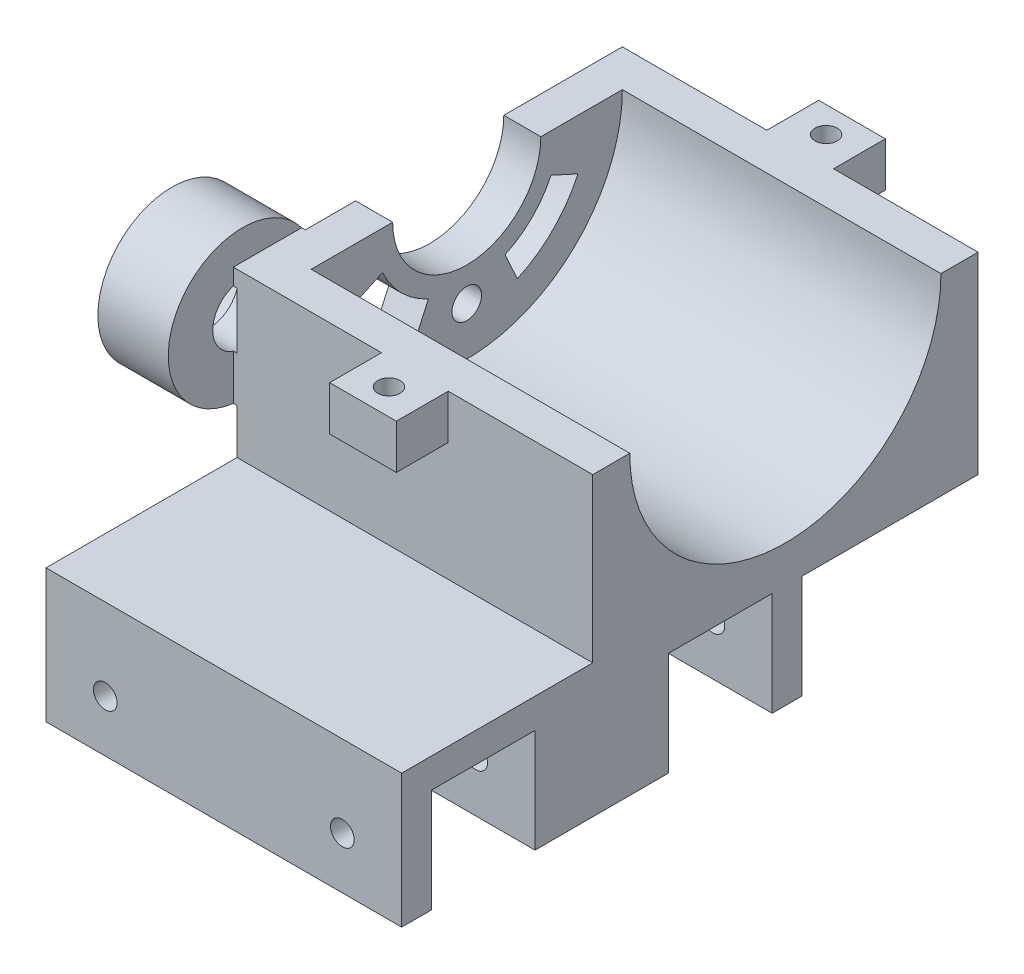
ISO-10303-21;
HEADER;
FILE_DESCRIPTION(('STEP AP214'),'2;1');
FILE_NAME('part.step','',(''),(''),'','','');
FILE_SCHEMA(('AUTOMOTIVE_DESIGN { 1 0 10303 214 1 1 1 1 }'));
ENDSEC;
DATA;
#1=APPLICATION_CONTEXT('core data for automotive mechanical design processes');
#2=APPLICATION_PROTOCOL_DEFINITION('international standard','automotive_design',2000,#1);
#3=PRODUCT_CONTEXT('',#1,'mechanical');
#4=PRODUCT('Part','Part','',(#3));
#5=PRODUCT_RELATED_PRODUCT_CATEGORY('part','',(#4));
#6=PRODUCT_DEFINITION_FORMATION('','',#4);
#7=PRODUCT_DEFINITION_CONTEXT('part definition',#1,'design');
#8=PRODUCT_DEFINITION('design','',#6,#7);
#9=PRODUCT_DEFINITION_SHAPE('','',#8);
#10=(LENGTH_UNIT() NAMED_UNIT(*) SI_UNIT(.MILLI.,.METRE.));
#11=(NAMED_UNIT(*) PLANE_ANGLE_UNIT() SI_UNIT($,.RADIAN.));
#12=(NAMED_UNIT(*) SI_UNIT($,.STERADIAN.) SOLID_ANGLE_UNIT());
#13=UNCERTAINTY_MEASURE_WITH_UNIT(LENGTH_MEASURE(1.E-05),#10,'distance_accuracy_value','');
#14=(GEOMETRIC_REPRESENTATION_CONTEXT(3) GLOBAL_UNCERTAINTY_ASSIGNED_CONTEXT((#13)) GLOBAL_UNIT_ASSIGNED_CONTEXT((#10,
#11,#12)) REPRESENTATION_CONTEXT('',''));
#15=CARTESIAN_POINT('',(0.,0.,0.));
#16=DIRECTION('',(0.,0.,1.));
#17=DIRECTION('',(1.,0.,0.));
#18=AXIS2_PLACEMENT_3D('',#15,#16,#17);
#19=CARTESIAN_POINT('',(0.,0.,0.));
#20=DIRECTION('',(0.,1.,0.));
#21=DIRECTION('',(0.,0.,1.));
#22=AXIS2_PLACEMENT_3D('',#19,#20,#21);
#23=PLANE('',#22);
#24=DIRECTION('',(1.,0.,0.));
#25=VECTOR('',#24,1.);
#26=CARTESIAN_POINT('',(-67.7715735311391,0.,21.5260853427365));
#27=LINE('',#26,#25);
#28=CARTESIAN_POINT('',(-27.522349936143,0.,21.5260853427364));
#29=VERTEX_POINT('',#28);
#30=CARTESIAN_POINT('',(20.477650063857,0.,21.5260853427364));
#31=VERTEX_POINT('',#30);
#32=EDGE_CURVE('E622',#29,#31,#27,.T.);
#33=ORIENTED_EDGE('',*,*,#32,.T.);
#34=DIRECTION('',(0.,0.,-1.));
#35=VECTOR('',#34,1.);
#36=CARTESIAN_POINT('',(20.477650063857,0.,-6.25798212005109));
#37=LINE('',#36,#35);
#38=CARTESIAN_POINT('',(20.477650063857,0.,35.5260853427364));
#39=VERTEX_POINT('',#38);
#40=EDGE_CURVE('E998',#39,#31,#37,.T.);
#41=ORIENTED_EDGE('',*,*,#40,.F.);
#42=DIRECTION('',(1.,0.,0.));
#43=VECTOR('',#42,1.);
#44=CARTESIAN_POINT('',(-67.7715735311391,0.,35.5260853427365));
#45=LINE('',#44,#43);
#46=CARTESIAN_POINT('',(-27.522349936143,0.,35.5260853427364));
#47=VERTEX_POINT('',#46);
#48=EDGE_CURVE('E676',#47,#39,#45,.T.);
#49=ORIENTED_EDGE('',*,*,#48,.F.);
#50=DIRECTION('',(0.,0.,1.));
#51=VECTOR('',#50,1.);
#52=CARTESIAN_POINT('',(-27.522349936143,0.,-6.25798212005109));
#53=LINE('',#52,#51);
#54=EDGE_CURVE('E974',#29,#47,#53,.T.);
#55=ORIENTED_EDGE('',*,*,#54,.F.);
#56=EDGE_LOOP('',(#33,#41,#49,#55));
#57=FACE_BOUND('',#56,.T.);
#58=ADVANCED_FACE('F37',(#57),#23,.F.);
#59=DIRECTION('',(1.,0.,0.));
#60=VECTOR('',#59,1.);
#61=CARTESIAN_POINT('',(-67.7715735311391,0.,17.5260853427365));
#62=LINE('',#61,#60);
#63=CARTESIAN_POINT('',(-27.522349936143,0.,17.5260853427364));
#64=VERTEX_POINT('',#63);
#65=CARTESIAN_POINT('',(20.477650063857,0.,17.5260853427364));
#66=VERTEX_POINT('',#65);
#67=EDGE_CURVE('E618',#64,#66,#62,.T.);
#68=ORIENTED_EDGE('',*,*,#67,.F.);
#69=CARTESIAN_POINT('',(-27.522349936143,0.,-6.25798212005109));
#70=VERTEX_POINT('',#69);
#71=EDGE_CURVE('E994',#70,#64,#53,.T.);
#72=ORIENTED_EDGE('',*,*,#71,.F.);
#73=DIRECTION('',(-1.,0.,0.));
#74=VECTOR('',#73,1.);
#75=CARTESIAN_POINT('',(-27.522349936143,0.,-6.25798212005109));
#76=LINE('',#75,#74);
#77=CARTESIAN_POINT('',(20.477650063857,0.,-6.25798212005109));
#78=VERTEX_POINT('',#77);
#79=EDGE_CURVE('E1001',#78,#70,#76,.T.);
#80=ORIENTED_EDGE('',*,*,#79,.F.);
#81=EDGE_CURVE('E997',#66,#78,#37,.T.);
#82=ORIENTED_EDGE('',*,*,#81,.F.);
#83=EDGE_LOOP('',(#68,#72,#80,#82));
#84=FACE_BOUND('',#83,.T.);
#85=ADVANCED_FACE('F1090',(#84),#23,.F.);
#86=CARTESIAN_POINT('',(-27.522349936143,26.,45.7420178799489));
#87=DIRECTION('',(0.,0.,-1.));
#88=DIRECTION('',(-1.,0.,0.));
#89=AXIS2_PLACEMENT_3D('',#86,#87,#88);
#90=PLANE('',#89);
#91=DIRECTION('',(1.,0.,0.));
#92=VECTOR('',#91,1.);
#93=CARTESIAN_POINT('',(-67.7715735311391,4.,45.7420178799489));
#94=LINE('',#93,#92);
#95=CARTESIAN_POINT('',(-27.522349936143,4.,45.7420178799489));
#96=VERTEX_POINT('',#95);
#97=CARTESIAN_POINT('',(20.477650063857,4.,45.7420178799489));
#98=VERTEX_POINT('',#97);
#99=EDGE_CURVE('E673',#96,#98,#94,.T.);
#100=ORIENTED_EDGE('',*,*,#99,.T.);
#101=DIRECTION('',(0.,-1.,0.));
#102=VECTOR('',#101,1.);
#103=CARTESIAN_POINT('',(20.477650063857,26.,45.7420178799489));
#104=LINE('',#103,#102);
#105=CARTESIAN_POINT('',(20.477650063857,26.,45.7420178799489));
#106=VERTEX_POINT('',#105);
#107=EDGE_CURVE('E1008',#106,#98,#104,.T.);
#108=ORIENTED_EDGE('',*,*,#107,.F.);
#109=DIRECTION('',(1.,0.,0.));
#110=VECTOR('',#109,1.);
#111=CARTESIAN_POINT('',(-27.522349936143,26.,45.7420178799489));
#112=LINE('',#111,#110);
#113=CARTESIAN_POINT('',(0.977650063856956,26.,45.7420178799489));
#114=VERTEX_POINT('',#113);
#115=EDGE_CURVE('E980',#114,#106,#112,.T.);
#116=ORIENTED_EDGE('',*,*,#115,.F.);
#117=DIRECTION('',(0.,1.,0.));
#118=VECTOR('',#117,1.);
#119=CARTESIAN_POINT('',(0.977650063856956,20.,45.7420178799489));
#120=LINE('',#119,#118);
#121=CARTESIAN_POINT('',(0.977650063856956,20.,45.7420178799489));
#122=VERTEX_POINT('',#121);
#123=EDGE_CURVE('E866',#122,#114,#120,.T.);
#124=ORIENTED_EDGE('',*,*,#123,.F.);
#125=DIRECTION('',(1.,0.,0.));
#126=VECTOR('',#125,1.);
#127=CARTESIAN_POINT('',(0.,20.,45.7420178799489));
#128=LINE('',#127,#126);
#129=CARTESIAN_POINT('',(-8.02234993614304,20.,45.7420178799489));
#130=VERTEX_POINT('',#129);
#131=EDGE_CURVE('E857',#130,#122,#128,.T.);
#132=ORIENTED_EDGE('',*,*,#131,.F.);
#133=DIRECTION('',(0.,1.,0.));
#134=VECTOR('',#133,1.);
#135=CARTESIAN_POINT('',(-8.02234993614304,20.,45.7420178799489));
#136=LINE('',#135,#134);
#137=CARTESIAN_POINT('',(-8.02234993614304,26.,45.7420178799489));
#138=VERTEX_POINT('',#137);
#139=EDGE_CURVE('E882',#130,#138,#136,.T.);
#140=ORIENTED_EDGE('',*,*,#139,.T.);
#141=CARTESIAN_POINT('',(-28.022349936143,26.,45.7420178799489));
#142=VERTEX_POINT('',#141);
#143=EDGE_CURVE('E982',#142,#138,#112,.T.);
#144=ORIENTED_EDGE('',*,*,#143,.F.);
#145=DIRECTION('',(0.,1.,0.));
#146=VECTOR('',#145,1.);
#147=CARTESIAN_POINT('',(-28.022349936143,23.8107096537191,45.7420178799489));
#148=LINE('',#147,#146);
#149=CARTESIAN_POINT('',(-28.022349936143,23.8107096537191,45.7420178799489));
#150=VERTEX_POINT('',#149);
#151=EDGE_CURVE('E695',#150,#142,#148,.T.);
#152=ORIENTED_EDGE('',*,*,#151,.F.);
#153=DIRECTION('',(1.,0.,0.));
#154=VECTOR('',#153,1.);
#155=CARTESIAN_POINT('',(-28.022349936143,23.8107096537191,45.7420178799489));
#156=LINE('',#155,#154);
#157=CARTESIAN_POINT('',(-27.522349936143,23.8107096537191,45.7420178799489));
#158=VERTEX_POINT('',#157);
#159=EDGE_CURVE('E705',#150,#158,#156,.T.);
#160=ORIENTED_EDGE('',*,*,#159,.T.);
#161=DIRECTION('',(0.,-1.,0.));
#162=VECTOR('',#161,1.);
#163=CARTESIAN_POINT('',(-27.522349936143,26.,45.7420178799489));
#164=LINE('',#163,#162);
#165=CARTESIAN_POINT('',(-27.522349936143,16.1892903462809,45.7420178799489));
#166=VERTEX_POINT('',#165);
#167=EDGE_CURVE('E1012',#158,#166,#164,.T.);
#168=ORIENTED_EDGE('',*,*,#167,.T.);
#169=DIRECTION('',(1.,0.,0.));
#170=VECTOR('',#169,1.);
#171=CARTESIAN_POINT('',(-28.022349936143,16.1892903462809,45.7420178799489));
#172=LINE('',#171,#170);
#173=CARTESIAN_POINT('',(-28.022349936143,16.1892903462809,45.7420178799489));
#174=VERTEX_POINT('',#173);
#175=EDGE_CURVE('E707',#174,#166,#172,.T.);
#176=ORIENTED_EDGE('',*,*,#175,.F.);
#177=DIRECTION('',(0.,1.,0.));
#178=VECTOR('',#177,1.);
#179=CARTESIAN_POINT('',(-28.022349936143,10.0741998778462,45.7420178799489));
#180=LINE('',#179,#178);
#181=CARTESIAN_POINT('',(-28.022349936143,10.0741998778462,45.7420178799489));
#182=VERTEX_POINT('',#181);
#183=EDGE_CURVE('E690',#182,#174,#180,.T.);
#184=ORIENTED_EDGE('',*,*,#183,.F.);
#185=DIRECTION('',(1.,0.,0.));
#186=VECTOR('',#185,1.);
#187=CARTESIAN_POINT('',(-28.022349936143,10.0741998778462,45.7420178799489));
#188=LINE('',#187,#186);
#189=CARTESIAN_POINT('',(-27.522349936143,10.0741998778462,45.7420178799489));
#190=VERTEX_POINT('',#189);
#191=EDGE_CURVE('E701',#182,#190,#188,.T.);
#192=ORIENTED_EDGE('',*,*,#191,.T.);
#193=EDGE_CURVE('E1011',#190,#96,#164,.T.);
#194=ORIENTED_EDGE('',*,*,#193,.T.);
#195=EDGE_LOOP('',(#100,#108,#116,#124,#132,#140,#144,#152,#160,#168,#176,#184,#192,#194));
#196=FACE_BOUND('',#195,.T.);
#197=ADVANCED_FACE('F1097',(#196),#90,.F.);
#198=CARTESIAN_POINT('',(-3.52234993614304,20.,49.2420178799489));
#199=DIRECTION('',(0.,1.,0.));
#200=DIRECTION('',(0.,0.,1.));
#201=AXIS2_PLACEMENT_3D('',#198,#199,#200);
#202=CYLINDRICAL_SURFACE('',#201,1.5);
#203=CARTESIAN_POINT('',(-3.52234993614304,26.,49.2420178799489));
#204=DIRECTION('',(0.,1.,0.));
#205=DIRECTION('',(0.,0.,1.));
#206=AXIS2_PLACEMENT_3D('',#203,#204,#205);
#207=CIRCLE('',#206,1.5);
#208=CARTESIAN_POINT('',(-3.52234993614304,26.,50.7420178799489));
#209=VERTEX_POINT('',#208);
#210=EDGE_CURVE('E848',#209,#209,#207,.T.);
#211=ORIENTED_EDGE('',*,*,#210,.T.);
#212=EDGE_LOOP('',(#211));
#213=FACE_BOUND('',#212,.T.);
#214=CARTESIAN_POINT('',(-3.52234993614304,22.5,49.2420178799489));
#215=DIRECTION('',(0.,-1.,0.));
#216=DIRECTION('',(0.,0.,-1.));
#217=AXIS2_PLACEMENT_3D('',#214,#215,#216);
#218=CIRCLE('',#217,1.5);
#219=CARTESIAN_POINT('',(-3.52234993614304,22.5,47.7420178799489));
#220=VERTEX_POINT('',#219);
#221=EDGE_CURVE('E724',#220,#220,#218,.T.);
#222=ORIENTED_EDGE('',*,*,#221,.T.);
#223=EDGE_LOOP('',(#222));
#224=FACE_BOUND('',#223,.T.);
#225=ADVANCED_FACE('F1113',(#213,#224),#202,.F.);
#226=CARTESIAN_POINT('',(0.,20.,0.));
#227=DIRECTION('',(0.,1.,0.));
#228=DIRECTION('',(0.,0.,1.));
#229=AXIS2_PLACEMENT_3D('',#226,#227,#228);
#230=PLANE('',#229);
#231=DIRECTION('',(0.,0.,1.));
#232=VECTOR('',#231,1.);
#233=CARTESIAN_POINT('',(0.977650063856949,20.,0.));
#234=LINE('',#233,#232);
#235=CARTESIAN_POINT('',(0.977650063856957,20.,52.7420178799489));
#236=VERTEX_POINT('',#235);
#237=EDGE_CURVE('E855',#122,#236,#234,.T.);
#238=ORIENTED_EDGE('',*,*,#237,.T.);
#239=DIRECTION('',(1.,0.,0.));
#240=VECTOR('',#239,1.);
#241=CARTESIAN_POINT('',(0.,20.,52.7420178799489));
#242=LINE('',#241,#240);
#243=CARTESIAN_POINT('',(-8.02234993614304,20.,52.7420178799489));
#244=VERTEX_POINT('',#243);
#245=EDGE_CURVE('E863',#244,#236,#242,.T.);
#246=ORIENTED_EDGE('',*,*,#245,.F.);
#247=DIRECTION('',(0.,0.,1.));
#248=VECTOR('',#247,1.);
#249=CARTESIAN_POINT('',(-8.02234993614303,20.,0.));
#250=LINE('',#249,#248);
#251=EDGE_CURVE('E860',#130,#244,#250,.T.);
#252=ORIENTED_EDGE('',*,*,#251,.F.);
#253=ORIENTED_EDGE('',*,*,#131,.T.);
#254=EDGE_LOOP('',(#238,#246,#252,#253));
#255=FACE_BOUND('',#254,.T.);
#256=DIRECTION('',(0.918032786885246,0.,0.39650447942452));
#257=VECTOR('',#256,1.);
#258=CARTESIAN_POINT('',(-19.5882786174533,20.,45.3530362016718));
#259=LINE('',#258,#257);
#260=CARTESIAN_POINT('',(-6.32234993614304,20.,51.0826792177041));
#261=VERTEX_POINT('',#260);
#262=CARTESIAN_POINT('',(-3.52234993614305,20.,52.2920178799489));
#263=VERTEX_POINT('',#262);
#264=EDGE_CURVE('E745',#261,#263,#259,.T.);
#265=ORIENTED_EDGE('',*,*,#264,.T.);
#266=DIRECTION('',(0.918032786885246,0.,-0.39650447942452));
#267=VECTOR('',#266,1.);
#268=CARTESIAN_POINT('',(18.4807404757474,20.,42.7887364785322));
#269=LINE('',#268,#267);
#270=CARTESIAN_POINT('',(-0.722349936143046,20.,51.0826792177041));
#271=VERTEX_POINT('',#270);
#272=EDGE_CURVE('E728',#263,#271,#269,.T.);
#273=ORIENTED_EDGE('',*,*,#272,.T.);
#274=DIRECTION('',(0.,0.,-1.));
#275=VECTOR('',#274,1.);
#276=CARTESIAN_POINT('',(-0.722349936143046,20.,0.));
#277=LINE('',#276,#275);
#278=CARTESIAN_POINT('',(-0.722349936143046,20.,47.4013565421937));
#279=VERTEX_POINT('',#278);
#280=EDGE_CURVE('E758',#271,#279,#277,.T.);
#281=ORIENTED_EDGE('',*,*,#280,.T.);
#282=DIRECTION('',(0.918032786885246,0.,0.39650447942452));
#283=VECTOR('',#282,1.);
#284=CARTESIAN_POINT('',(-17.3678535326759,20.,40.2120525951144));
#285=LINE('',#284,#283);
#286=CARTESIAN_POINT('',(-3.52234993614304,20.,46.1920178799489));
#287=VERTEX_POINT('',#286);
#288=EDGE_CURVE('E755',#287,#279,#285,.T.);
#289=ORIENTED_EDGE('',*,*,#288,.F.);
#290=DIRECTION('',(0.918032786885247,0.,-0.396504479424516));
#291=VECTOR('',#290,1.);
#292=CARTESIAN_POINT('',(16.26031539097,20.,37.647752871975));
#293=LINE('',#292,#291);
#294=CARTESIAN_POINT('',(-6.32234993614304,20.,47.4013565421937));
#295=VERTEX_POINT('',#294);
#296=EDGE_CURVE('E752',#295,#287,#293,.T.);
#297=ORIENTED_EDGE('',*,*,#296,.F.);
#298=DIRECTION('',(0.,0.,-1.));
#299=VECTOR('',#298,1.);
#300=CARTESIAN_POINT('',(-6.32234993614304,20.,0.));
#301=LINE('',#300,#299);
#302=EDGE_CURVE('E748',#261,#295,#301,.T.);
#303=ORIENTED_EDGE('',*,*,#302,.F.);
#304=EDGE_LOOP('',(#265,#273,#281,#289,#297,#303));
#305=FACE_BOUND('',#304,.T.);
#306=ADVANCED_FACE('F1119',(#255,#305),#230,.F.);
#307=CARTESIAN_POINT('',(-3.52234993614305,20.,-9.75798212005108));
#308=DIRECTION('',(0.,1.,0.));
#309=DIRECTION('',(0.,0.,1.));
#310=AXIS2_PLACEMENT_3D('',#307,#308,#309);
#311=CYLINDRICAL_SURFACE('',#310,1.5);
#312=CARTESIAN_POINT('',(-3.52234993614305,26.,-9.75798212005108));
#313=DIRECTION('',(0.,1.,0.));
#314=DIRECTION('',(0.,0.,1.));
#315=AXIS2_PLACEMENT_3D('',#312,#313,#314);
#316=CIRCLE('',#315,1.5);
#317=CARTESIAN_POINT('',(-3.52234993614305,26.,-8.25798212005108));
#318=VERTEX_POINT('',#317);
#319=EDGE_CURVE('E766',#318,#318,#316,.T.);
#320=ORIENTED_EDGE('',*,*,#319,.T.);
#321=EDGE_LOOP('',(#320));
#322=FACE_BOUND('',#321,.T.);
#323=CARTESIAN_POINT('',(-3.52234993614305,22.5,-9.75798212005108));
#324=DIRECTION('',(0.,-1.,0.));
#325=DIRECTION('',(0.,0.,-1.));
#326=AXIS2_PLACEMENT_3D('',#323,#324,#325);
#327=CIRCLE('',#326,1.5);
#328=CARTESIAN_POINT('',(-3.52234993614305,22.5,-11.2579821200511));
#329=VERTEX_POINT('',#328);
#330=EDGE_CURVE('E794',#329,#329,#327,.F.);
#331=ORIENTED_EDGE('',*,*,#330,.F.);
#332=EDGE_LOOP('',(#331));
#333=FACE_BOUND('',#332,.T.);
#334=ADVANCED_FACE('F1703',(#322,#333),#311,.F.);
#335=CARTESIAN_POINT('',(0.,20.,0.));
#336=DIRECTION('',(0.,1.,0.));
#337=DIRECTION('',(0.,0.,1.));
#338=AXIS2_PLACEMENT_3D('',#335,#336,#337);
#339=PLANE('',#338);
#340=DIRECTION('',(0.,0.,1.));
#341=VECTOR('',#340,1.);
#342=CARTESIAN_POINT('',(0.977650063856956,20.,0.));
#343=LINE('',#342,#341);
#344=CARTESIAN_POINT('',(0.977650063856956,20.,-13.2579821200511));
#345=VERTEX_POINT('',#344);
#346=CARTESIAN_POINT('',(0.977650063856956,20.,-6.25798212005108));
#347=VERTEX_POINT('',#346);
#348=EDGE_CURVE('E826',#345,#347,#343,.T.);
#349=ORIENTED_EDGE('',*,*,#348,.T.);
#350=DIRECTION('',(1.,0.,0.));
#351=VECTOR('',#350,1.);
#352=CARTESIAN_POINT('',(0.,20.,-6.25798212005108));
#353=LINE('',#352,#351);
#354=CARTESIAN_POINT('',(-8.02234993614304,20.,-6.25798212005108));
#355=VERTEX_POINT('',#354);
#356=EDGE_CURVE('E833',#355,#347,#353,.T.);
#357=ORIENTED_EDGE('',*,*,#356,.F.);
#358=DIRECTION('',(0.,0.,1.));
#359=VECTOR('',#358,1.);
#360=CARTESIAN_POINT('',(-8.02234993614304,20.,0.));
#361=LINE('',#360,#359);
#362=CARTESIAN_POINT('',(-8.02234993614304,20.,-13.2579821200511));
#363=VERTEX_POINT('',#362);
#364=EDGE_CURVE('E831',#363,#355,#361,.T.);
#365=ORIENTED_EDGE('',*,*,#364,.F.);
#366=DIRECTION('',(1.,0.,0.));
#367=VECTOR('',#366,1.);
#368=CARTESIAN_POINT('',(0.,20.,-13.2579821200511));
#369=LINE('',#368,#367);
#370=EDGE_CURVE('E828',#363,#345,#369,.T.);
#371=ORIENTED_EDGE('',*,*,#370,.T.);
#372=EDGE_LOOP('',(#349,#357,#365,#371));
#373=FACE_BOUND('',#372,.T.);
#374=DIRECTION('',(0.918032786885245,0.,0.39650447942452));
#375=VECTOR('',#374,1.);
#376=CARTESIAN_POINT('',(1.88796400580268,20.,-4.37123146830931));
#377=LINE('',#376,#375);
#378=CARTESIAN_POINT('',(-6.32234993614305,20.,-7.91732078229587));
#379=VERTEX_POINT('',#378);
#380=CARTESIAN_POINT('',(-3.52234993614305,20.,-6.70798212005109));
#381=VERTEX_POINT('',#380);
#382=EDGE_CURVE('E721',#379,#381,#377,.T.);
#383=ORIENTED_EDGE('',*,*,#382,.T.);
#384=DIRECTION('',(0.918032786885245,0.,-0.396504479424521));
#385=VECTOR('',#384,1.);
#386=CARTESIAN_POINT('',(-2.99550214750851,20.,-6.93553119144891));
#387=LINE('',#386,#385);
#388=CARTESIAN_POINT('',(-0.722349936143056,20.,-7.91732078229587));
#389=VERTEX_POINT('',#388);
#390=EDGE_CURVE('E781',#381,#389,#387,.T.);
#391=ORIENTED_EDGE('',*,*,#390,.T.);
#392=DIRECTION('',(0.,0.,-1.));
#393=VECTOR('',#392,1.);
#394=CARTESIAN_POINT('',(-0.722349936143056,20.,0.));
#395=LINE('',#394,#393);
#396=CARTESIAN_POINT('',(-0.722349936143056,20.,-11.5986434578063));
#397=VERTEX_POINT('',#396);
#398=EDGE_CURVE('E809',#389,#397,#395,.T.);
#399=ORIENTED_EDGE('',*,*,#398,.T.);
#400=DIRECTION('',(0.918032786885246,0.,0.39650447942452));
#401=VECTOR('',#400,1.);
#402=CARTESIAN_POINT('',(4.10838909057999,20.,-9.5122150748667));
#403=LINE('',#402,#401);
#404=CARTESIAN_POINT('',(-3.52234993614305,20.,-12.8079821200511));
#405=VERTEX_POINT('',#404);
#406=EDGE_CURVE('E806',#405,#397,#403,.T.);
#407=ORIENTED_EDGE('',*,*,#406,.F.);
#408=DIRECTION('',(0.918032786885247,0.,-0.396504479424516));
#409=VECTOR('',#408,1.);
#410=CARTESIAN_POINT('',(-5.21592723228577,20.,-12.0765147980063));
#411=LINE('',#410,#409);
#412=CARTESIAN_POINT('',(-6.32234993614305,20.,-11.5986434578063));
#413=VERTEX_POINT('',#412);
#414=EDGE_CURVE('E803',#413,#405,#411,.T.);
#415=ORIENTED_EDGE('',*,*,#414,.F.);
#416=DIRECTION('',(0.,0.,-1.));
#417=VECTOR('',#416,1.);
#418=CARTESIAN_POINT('',(-6.32234993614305,20.,0.));
#419=LINE('',#418,#417);
#420=EDGE_CURVE('E800',#379,#413,#419,.T.);
#421=ORIENTED_EDGE('',*,*,#420,.F.);
#422=EDGE_LOOP('',(#383,#391,#399,#407,#415,#421));
#423=FACE_BOUND('',#422,.T.);
#424=ADVANCED_FACE('F1107',(#373,#423),#339,.F.);
#425=CARTESIAN_POINT('',(-27.522349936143,26.,-6.25798212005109));
#426=DIRECTION('',(0.,0.,1.));
#427=DIRECTION('',(1.,0.,0.));
#428=AXIS2_PLACEMENT_3D('',#425,#426,#427);
#429=PLANE('',#428);
#430=DIRECTION('',(0.,1.,0.));
#431=VECTOR('',#430,1.);
#432=CARTESIAN_POINT('',(-8.02234993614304,20.,-6.25798212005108));
#433=LINE('',#432,#431);
#434=CARTESIAN_POINT('',(-8.02234993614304,26.,-6.25798212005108));
#435=VERTEX_POINT('',#434);
#436=EDGE_CURVE('E849',#355,#435,#433,.T.);
#437=ORIENTED_EDGE('',*,*,#436,.F.);
#438=ORIENTED_EDGE('',*,*,#356,.T.);
#439=DIRECTION('',(0.,1.,0.));
#440=VECTOR('',#439,1.);
#441=CARTESIAN_POINT('',(0.977650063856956,20.,-6.25798212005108));
#442=LINE('',#441,#440);
#443=CARTESIAN_POINT('',(0.977650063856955,26.,-6.25798212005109));
#444=VERTEX_POINT('',#443);
#445=EDGE_CURVE('E845',#347,#444,#442,.T.);
#446=ORIENTED_EDGE('',*,*,#445,.T.);
#447=DIRECTION('',(-1.,0.,0.));
#448=VECTOR('',#447,1.);
#449=CARTESIAN_POINT('',(-27.522349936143,26.,-6.25798212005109));
#450=LINE('',#449,#448);
#451=CARTESIAN_POINT('',(20.477650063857,26.,-6.25798212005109));
#452=VERTEX_POINT('',#451);
#453=EDGE_CURVE('E990',#452,#444,#450,.T.);
#454=ORIENTED_EDGE('',*,*,#453,.F.);
#455=DIRECTION('',(0.,-1.,0.));
#456=VECTOR('',#455,1.);
#457=CARTESIAN_POINT('',(20.477650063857,26.,-6.25798212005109));
#458=LINE('',#457,#456);
#459=EDGE_CURVE('E1005',#452,#78,#458,.T.);
#460=ORIENTED_EDGE('',*,*,#459,.T.);
#461=ORIENTED_EDGE('',*,*,#79,.T.);
#462=DIRECTION('',(0.,-1.,0.));
#463=VECTOR('',#462,1.);
#464=CARTESIAN_POINT('',(-27.522349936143,26.,-6.25798212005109));
#465=LINE('',#464,#463);
#466=CARTESIAN_POINT('',(-27.522349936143,26.,-6.25798212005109));
#467=VERTEX_POINT('',#466);
#468=EDGE_CURVE('E993',#467,#70,#465,.T.);
#469=ORIENTED_EDGE('',*,*,#468,.F.);
#470=EDGE_CURVE('E989',#435,#467,#450,.T.);
#471=ORIENTED_EDGE('',*,*,#470,.F.);
#472=EDGE_LOOP('',(#437,#438,#446,#454,#460,#461,#469,#471));
#473=FACE_BOUND('',#472,.T.);
#474=ADVANCED_FACE('F1103',(#473),#429,.F.);
#475=CARTESIAN_POINT('',(0.,26.,0.));
#476=DIRECTION('',(0.,1.,0.));
#477=DIRECTION('',(0.,0.,1.));
#478=AXIS2_PLACEMENT_3D('',#475,#476,#477);
#479=PLANE('',#478);
#480=DIRECTION('',(-1.,0.,0.));
#481=VECTOR('',#480,1.);
#482=CARTESIAN_POINT('',(20.477650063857,26.,9.7420178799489));
#483=LINE('',#482,#481);
#484=CARTESIAN_POINT('',(-22.522349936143,26.,9.74201787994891));
#485=VERTEX_POINT('',#484);
#486=CARTESIAN_POINT('',(-27.522349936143,26.,9.74201787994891));
#487=VERTEX_POINT('',#486);
#488=EDGE_CURVE('E958',#485,#487,#483,.T.);
#489=ORIENTED_EDGE('',*,*,#488,.F.);
#490=DIRECTION('',(0.,0.,1.));
#491=VECTOR('',#490,1.);
#492=CARTESIAN_POINT('',(-22.522349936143,26.,0.));
#493=LINE('',#492,#491);
#494=CARTESIAN_POINT('',(-22.522349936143,26.,-1.2579821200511));
#495=VERTEX_POINT('',#494);
#496=EDGE_CURVE('E967',#495,#485,#493,.T.);
#497=ORIENTED_EDGE('',*,*,#496,.F.);
#498=DIRECTION('',(1.,0.,0.));
#499=VECTOR('',#498,1.);
#500=CARTESIAN_POINT('',(-22.522349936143,26.,-1.2579821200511));
#501=LINE('',#500,#499);
#502=CARTESIAN_POINT('',(20.477650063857,26.,-1.2579821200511));
#503=VERTEX_POINT('',#502);
#504=EDGE_CURVE('E970',#495,#503,#501,.T.);
#505=ORIENTED_EDGE('',*,*,#504,.T.);
#506=DIRECTION('',(0.,0.,-1.));
#507=VECTOR('',#506,1.);
#508=CARTESIAN_POINT('',(20.477650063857,26.,-6.25798212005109));
#509=LINE('',#508,#507);
#510=EDGE_CURVE('E985',#503,#452,#509,.T.);
#511=ORIENTED_EDGE('',*,*,#510,.T.);
#512=ORIENTED_EDGE('',*,*,#453,.T.);
#513=DIRECTION('',(0.,0.,1.));
#514=VECTOR('',#513,1.);
#515=CARTESIAN_POINT('',(0.977650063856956,26.,0.));
#516=LINE('',#515,#514);
#517=CARTESIAN_POINT('',(0.977650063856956,26.,-13.2579821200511));
#518=VERTEX_POINT('',#517);
#519=EDGE_CURVE('E839',#518,#444,#516,.T.);
#520=ORIENTED_EDGE('',*,*,#519,.F.);
#521=DIRECTION('',(1.,0.,0.));
#522=VECTOR('',#521,1.);
#523=CARTESIAN_POINT('',(0.,26.,-13.2579821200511));
#524=LINE('',#523,#522);
#525=CARTESIAN_POINT('',(-8.02234993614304,26.,-13.2579821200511));
#526=VERTEX_POINT('',#525);
#527=EDGE_CURVE('E841',#526,#518,#524,.T.);
#528=ORIENTED_EDGE('',*,*,#527,.F.);
#529=DIRECTION('',(0.,0.,1.));
#530=VECTOR('',#529,1.);
#531=CARTESIAN_POINT('',(-8.02234993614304,26.,0.));
#532=LINE('',#531,#530);
#533=EDGE_CURVE('E829',#526,#435,#532,.T.);
#534=ORIENTED_EDGE('',*,*,#533,.T.);
#535=ORIENTED_EDGE('',*,*,#470,.T.);
#536=DIRECTION('',(0.,0.,1.));
#537=VECTOR('',#536,1.);
#538=CARTESIAN_POINT('',(-27.522349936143,26.,-6.25798212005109));
#539=LINE('',#538,#537);
#540=EDGE_CURVE('E977',#467,#487,#539,.T.);
#541=ORIENTED_EDGE('',*,*,#540,.T.);
#542=EDGE_LOOP('',(#489,#497,#505,#511,#512,#520,#528,#534,#535,#541));
#543=FACE_BOUND('',#542,.T.);
#544=ORIENTED_EDGE('',*,*,#319,.F.);
#545=EDGE_LOOP('',(#544));
#546=FACE_BOUND('',#545,.T.);
#547=ADVANCED_FACE('F1106',(#543,#546),#479,.T.);
#548=CARTESIAN_POINT('',(-27.522349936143,26.,-6.25798212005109));
#549=DIRECTION('',(1.,0.,0.));
#550=DIRECTION('',(0.,0.,-1.));
#551=AXIS2_PLACEMENT_3D('',#548,#549,#550);
#552=PLANE('',#551);
#553=DIRECTION('',(0.,0.,1.));
#554=VECTOR('',#553,1.);
#555=CARTESIAN_POINT('',(-27.522349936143,4.,0.));
#556=LINE('',#555,#554);
#557=CARTESIAN_POINT('',(-27.522349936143,4.,71.5260853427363));
#558=VERTEX_POINT('',#557);
#559=EDGE_CURVE('E636',#96,#558,#556,.T.);
#560=ORIENTED_EDGE('',*,*,#559,.F.);
#561=ORIENTED_EDGE('',*,*,#193,.F.);
#562=CARTESIAN_POINT('',(-27.522349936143,20.,44.5260853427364));
#563=DIRECTION('',(-1.,0.,0.));
#564=DIRECTION('',(0.,0.,1.));
#565=AXIS2_PLACEMENT_3D('',#562,#563,#564);
#566=CIRCLE('',#565,10.);
#567=CARTESIAN_POINT('',(-27.522349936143,18.8167416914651,34.5963371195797));
#568=VERTEX_POINT('',#567);
#569=EDGE_CURVE('E11',#568,#190,#566,.T.);
#570=ORIENTED_EDGE('',*,*,#569,.F.);
#571=CARTESIAN_POINT('',(-27.522349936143,26.,19.7420178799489));
#572=DIRECTION('',(-1.,0.,0.));
#573=DIRECTION('',(0.,0.,1.));
#574=AXIS2_PLACEMENT_3D('',#571,#572,#573);
#575=CIRCLE('',#574,16.5);
#576=CARTESIAN_POINT('',(-27.522349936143,10.9788793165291,26.5696040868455));
#577=VERTEX_POINT('',#576);
#578=EDGE_CURVE('E924',#577,#568,#575,.T.);
#579=ORIENTED_EDGE('',*,*,#578,.F.);
#580=DIRECTION('',(0.,-0.910370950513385,0.413793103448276));
#581=VECTOR('',#580,1.);
#582=CARTESIAN_POINT('',(-27.522349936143,11.8887642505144,26.1560318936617));
#583=LINE('',#582,#581);
#584=CARTESIAN_POINT('',(-27.522349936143,14.6203631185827,24.9144316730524));
#585=VERTEX_POINT('',#584);
#586=EDGE_CURVE('E929',#585,#577,#583,.T.);
#587=ORIENTED_EDGE('',*,*,#586,.F.);
#588=CARTESIAN_POINT('',(-27.522349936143,26.,19.7420178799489));
#589=DIRECTION('',(-1.,0.,0.));
#590=DIRECTION('',(0.,0.,1.));
#591=AXIS2_PLACEMENT_3D('',#588,#589,#590);
#592=CIRCLE('',#591,12.5);
#593=CARTESIAN_POINT('',(-27.522349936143,20.8050877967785,31.1114016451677));
#594=VERTEX_POINT('',#593);
#595=EDGE_CURVE('E908',#585,#594,#592,.T.);
#596=ORIENTED_EDGE('',*,*,#595,.T.);
#597=DIRECTION('',(0.,-0.415592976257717,0.909550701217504));
#598=VECTOR('',#597,1.);
#599=CARTESIAN_POINT('',(-27.522349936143,28.9718841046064,13.2378673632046));
#600=LINE('',#599,#598);
#601=CARTESIAN_POINT('',(-27.522349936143,19.2313277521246,34.5556719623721));
#602=VERTEX_POINT('',#601);
#603=EDGE_CURVE('E919',#594,#602,#600,.T.);
#604=ORIENTED_EDGE('',*,*,#603,.T.);
#605=CARTESIAN_POINT('',(-27.522349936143,26.,36.5260853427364));
#606=VERTEX_POINT('',#605);
#607=EDGE_CURVE('E48',#606,#602,#566,.T.);
#608=ORIENTED_EDGE('',*,*,#607,.F.);
#609=CARTESIAN_POINT('',(-27.522349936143,26.,29.7420178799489));
#610=VERTEX_POINT('',#609);
#611=EDGE_CURVE('E981',#610,#606,#539,.T.);
#612=ORIENTED_EDGE('',*,*,#611,.F.);
#613=CARTESIAN_POINT('',(-27.522349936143,26.,19.7420178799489));
#614=DIRECTION('',(-1.,0.,0.));
#615=DIRECTION('',(0.,0.,1.));
#616=AXIS2_PLACEMENT_3D('',#613,#614,#615);
#617=CIRCLE('',#616,10.);
#618=EDGE_CURVE('E956',#487,#610,#617,.T.);
#619=ORIENTED_EDGE('',*,*,#618,.F.);
#620=ORIENTED_EDGE('',*,*,#540,.F.);
#621=ORIENTED_EDGE('',*,*,#468,.T.);
#622=ORIENTED_EDGE('',*,*,#71,.T.);
#623=DIRECTION('',(0.,1.,0.));
#624=VECTOR('',#623,1.);
#625=CARTESIAN_POINT('',(-27.522349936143,0.,17.5260853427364));
#626=LINE('',#625,#624);
#627=CARTESIAN_POINT('',(-27.522349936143,-14.,17.5260853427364));
#628=VERTEX_POINT('',#627);
#629=EDGE_CURVE('E608',#628,#64,#626,.T.);
#630=ORIENTED_EDGE('',*,*,#629,.F.);
#631=DIRECTION('',(0.,0.,1.));
#632=VECTOR('',#631,1.);
#633=CARTESIAN_POINT('',(-27.522349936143,-14.,0.));
#634=LINE('',#633,#632);
#635=CARTESIAN_POINT('',(-27.522349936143,-14.,21.5260853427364));
#636=VERTEX_POINT('',#635);
#637=EDGE_CURVE('E605',#628,#636,#634,.T.);
#638=ORIENTED_EDGE('',*,*,#637,.T.);
#639=DIRECTION('',(0.,-1.,0.));
#640=VECTOR('',#639,1.);
#641=CARTESIAN_POINT('',(-27.522349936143,0.,21.5260853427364));
#642=LINE('',#641,#640);
#643=EDGE_CURVE('E602',#29,#636,#642,.T.);
#644=ORIENTED_EDGE('',*,*,#643,.F.);
#645=ORIENTED_EDGE('',*,*,#54,.T.);
#646=DIRECTION('',(0.,1.,0.));
#647=VECTOR('',#646,1.);
#648=CARTESIAN_POINT('',(-27.522349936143,0.,35.5260853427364));
#649=LINE('',#648,#647);
#650=CARTESIAN_POINT('',(-27.522349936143,-14.,35.5260853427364));
#651=VERTEX_POINT('',#650);
#652=EDGE_CURVE('E633',#651,#47,#649,.T.);
#653=ORIENTED_EDGE('',*,*,#652,.F.);
#654=DIRECTION('',(0.,0.,1.));
#655=VECTOR('',#654,1.);
#656=CARTESIAN_POINT('',(-27.522349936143,-14.,0.));
#657=LINE('',#656,#655);
#658=CARTESIAN_POINT('',(-27.522349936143,-14.,53.5260853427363));
#659=VERTEX_POINT('',#658);
#660=EDGE_CURVE('E630',#651,#659,#657,.T.);
#661=ORIENTED_EDGE('',*,*,#660,.T.);
#662=DIRECTION('',(0.,-1.,0.));
#663=VECTOR('',#662,1.);
#664=CARTESIAN_POINT('',(-27.522349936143,0.,53.5260853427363));
#665=LINE('',#664,#663);
#666=CARTESIAN_POINT('',(-27.522349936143,0.,53.5260853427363));
#667=VERTEX_POINT('',#666);
#668=EDGE_CURVE('E627',#667,#659,#665,.T.);
#669=ORIENTED_EDGE('',*,*,#668,.F.);
#670=DIRECTION('',(0.,0.,-1.));
#671=VECTOR('',#670,1.);
#672=CARTESIAN_POINT('',(-27.522349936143,0.,0.));
#673=LINE('',#672,#671);
#674=CARTESIAN_POINT('',(-27.522349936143,0.,67.5260853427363));
#675=VERTEX_POINT('',#674);
#676=EDGE_CURVE('E631',#675,#667,#673,.T.);
#677=ORIENTED_EDGE('',*,*,#676,.F.);
#678=DIRECTION('',(0.,1.,0.));
#679=VECTOR('',#678,1.);
#680=CARTESIAN_POINT('',(-27.522349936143,0.,67.5260853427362));
#681=LINE('',#680,#679);
#682=CARTESIAN_POINT('',(-27.522349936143,-14.,67.5260853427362));
#683=VERTEX_POINT('',#682);
#684=EDGE_CURVE('E643',#683,#675,#681,.T.);
#685=ORIENTED_EDGE('',*,*,#684,.F.);
#686=DIRECTION('',(0.,0.,1.));
#687=VECTOR('',#686,1.);
#688=CARTESIAN_POINT('',(-27.522349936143,-14.,0.));
#689=LINE('',#688,#687);
#690=CARTESIAN_POINT('',(-27.522349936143,-14.,71.5260853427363));
#691=VERTEX_POINT('',#690);
#692=EDGE_CURVE('E641',#683,#691,#689,.T.);
#693=ORIENTED_EDGE('',*,*,#692,.T.);
#694=DIRECTION('',(0.,1.,0.));
#695=VECTOR('',#694,1.);
#696=CARTESIAN_POINT('',(-27.522349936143,0.,71.5260853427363));
#697=LINE('',#696,#695);
#698=EDGE_CURVE('E639',#691,#558,#697,.T.);
#699=ORIENTED_EDGE('',*,*,#698,.T.);
#700=EDGE_LOOP('',(#560,#561,#570,#579,#587,#596,#604,#608,#612,#619,#620,#621,#622,#630,#638,
#644,#645,#653,#661,#669,#677,#685,#693,#699));
#701=FACE_BOUND('',#700,.T.);
#702=CARTESIAN_POINT('',(-27.522349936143,26.,19.7420178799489));
#703=DIRECTION('',(-1.,0.,0.));
#704=DIRECTION('',(0.,0.,1.));
#705=AXIS2_PLACEMENT_3D('',#702,#703,#704);
#706=CIRCLE('',#705,16.5);
#707=CARTESIAN_POINT('',(-27.522349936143,19.1427158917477,4.7344313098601));
#708=VERTEX_POINT('',#707);
#709=CARTESIAN_POINT('',(-27.522349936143,10.9788793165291,12.9144316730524));
#710=VERTEX_POINT('',#709);
#711=EDGE_CURVE('E891',#708,#710,#706,.T.);
#712=ORIENTED_EDGE('',*,*,#711,.F.);
#713=DIRECTION('',(0.,-0.415592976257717,-0.909550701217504));
#714=VECTOR('',#713,1.);
#715=CARTESIAN_POINT('',(-27.522349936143,14.0468047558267,-6.41828255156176));
#716=LINE('',#715,#714);
#717=CARTESIAN_POINT('',(-27.522349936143,20.8050877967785,8.37263411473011));
#718=VERTEX_POINT('',#717);
#719=EDGE_CURVE('E895',#718,#708,#716,.T.);
#720=ORIENTED_EDGE('',*,*,#719,.F.);
#721=CARTESIAN_POINT('',(-27.522349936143,26.,19.7420178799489));
#722=DIRECTION('',(-1.,0.,0.));
#723=DIRECTION('',(0.,0.,1.));
#724=AXIS2_PLACEMENT_3D('',#721,#722,#723);
#725=CIRCLE('',#724,12.5);
#726=CARTESIAN_POINT('',(-27.522349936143,14.6203631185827,14.5696040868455));
#727=VERTEX_POINT('',#726);
#728=EDGE_CURVE('E899',#718,#727,#725,.T.);
#729=ORIENTED_EDGE('',*,*,#728,.T.);
#730=DIRECTION('',(0.,-0.910370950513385,-0.413793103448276));
#731=VECTOR('',#730,1.);
#732=CARTESIAN_POINT('',(-27.522349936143,-2.98507816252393,6.56736040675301));
#733=LINE('',#732,#731);
#734=EDGE_CURVE('E886',#727,#710,#733,.T.);
#735=ORIENTED_EDGE('',*,*,#734,.T.);
#736=EDGE_LOOP('',(#712,#720,#729,#735));
#737=FACE_BOUND('',#736,.T.);
#738=CARTESIAN_POINT('',(-27.522349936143,11.5,19.7420178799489));
#739=DIRECTION('',(-1.,0.,0.));
#740=DIRECTION('',(0.,0.,1.));
#741=AXIS2_PLACEMENT_3D('',#738,#739,#740);
#742=CIRCLE('',#741,2.);
#743=CARTESIAN_POINT('',(-27.522349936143,11.5,21.7420178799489));
#744=VERTEX_POINT('',#743);
#745=EDGE_CURVE('E902',#744,#744,#742,.T.);
#746=ORIENTED_EDGE('',*,*,#745,.F.);
#747=EDGE_LOOP('',(#746));
#748=FACE_BOUND('',#747,.T.);
#749=ADVANCED_FACE('F39',(#701,#737,#748),#552,.F.);
#750=CARTESIAN_POINT('',(20.477650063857,26.,-6.25798212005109));
#751=DIRECTION('',(-1.,0.,0.));
#752=DIRECTION('',(0.,0.,1.));
#753=AXIS2_PLACEMENT_3D('',#750,#751,#752);
#754=PLANE('',#753);
#755=ORIENTED_EDGE('',*,*,#510,.F.);
#756=CARTESIAN_POINT('',(20.477650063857,26.,19.7420178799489));
#757=DIRECTION('',(1.,0.,0.));
#758=DIRECTION('',(0.,0.,-1.));
#759=AXIS2_PLACEMENT_3D('',#756,#757,#758);
#760=CIRCLE('',#759,21.);
#761=CARTESIAN_POINT('',(20.477650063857,26.,40.7420178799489));
#762=VERTEX_POINT('',#761);
#763=EDGE_CURVE('E962',#762,#503,#760,.T.);
#764=ORIENTED_EDGE('',*,*,#763,.F.);
#765=EDGE_CURVE('E986',#106,#762,#509,.T.);
#766=ORIENTED_EDGE('',*,*,#765,.F.);
#767=ORIENTED_EDGE('',*,*,#107,.T.);
#768=DIRECTION('',(0.,0.,-1.));
#769=VECTOR('',#768,1.);
#770=CARTESIAN_POINT('',(20.477650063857,4.,0.));
#771=LINE('',#770,#769);
#772=CARTESIAN_POINT('',(20.477650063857,4.,71.5260853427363));
#773=VERTEX_POINT('',#772);
#774=EDGE_CURVE('E662',#773,#98,#771,.T.);
#775=ORIENTED_EDGE('',*,*,#774,.F.);
#776=DIRECTION('',(0.,-1.,0.));
#777=VECTOR('',#776,1.);
#778=CARTESIAN_POINT('',(20.477650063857,0.,71.5260853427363));
#779=LINE('',#778,#777);
#780=CARTESIAN_POINT('',(20.477650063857,-14.,71.5260853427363));
#781=VERTEX_POINT('',#780);
#782=EDGE_CURVE('E664',#773,#781,#779,.T.);
#783=ORIENTED_EDGE('',*,*,#782,.T.);
#784=DIRECTION('',(0.,0.,-1.));
#785=VECTOR('',#784,1.);
#786=CARTESIAN_POINT('',(20.477650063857,-14.,0.));
#787=LINE('',#786,#785);
#788=CARTESIAN_POINT('',(20.477650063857,-14.,67.5260853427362));
#789=VERTEX_POINT('',#788);
#790=EDGE_CURVE('E659',#781,#789,#787,.T.);
#791=ORIENTED_EDGE('',*,*,#790,.T.);
#792=DIRECTION('',(0.,-1.,0.));
#793=VECTOR('',#792,1.);
#794=CARTESIAN_POINT('',(20.477650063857,0.,67.5260853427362));
#795=LINE('',#794,#793);
#796=CARTESIAN_POINT('',(20.477650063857,0.,67.5260853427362));
#797=VERTEX_POINT('',#796);
#798=EDGE_CURVE('E610',#797,#789,#795,.T.);
#799=ORIENTED_EDGE('',*,*,#798,.F.);
#800=DIRECTION('',(0.,0.,1.));
#801=VECTOR('',#800,1.);
#802=CARTESIAN_POINT('',(20.477650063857,0.,0.));
#803=LINE('',#802,#801);
#804=CARTESIAN_POINT('',(20.477650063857,0.,53.5260853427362));
#805=VERTEX_POINT('',#804);
#806=EDGE_CURVE('E649',#805,#797,#803,.T.);
#807=ORIENTED_EDGE('',*,*,#806,.F.);
#808=DIRECTION('',(0.,1.,0.));
#809=VECTOR('',#808,1.);
#810=CARTESIAN_POINT('',(20.477650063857,0.,53.5260853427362));
#811=LINE('',#810,#809);
#812=CARTESIAN_POINT('',(20.477650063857,-14.,53.5260853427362));
#813=VERTEX_POINT('',#812);
#814=EDGE_CURVE('E652',#813,#805,#811,.T.);
#815=ORIENTED_EDGE('',*,*,#814,.F.);
#816=CARTESIAN_POINT('',(20.477650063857,-14.,35.5260853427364));
#817=VERTEX_POINT('',#816);
#818=EDGE_CURVE('E655',#813,#817,#787,.T.);
#819=ORIENTED_EDGE('',*,*,#818,.T.);
#820=DIRECTION('',(0.,-1.,0.));
#821=VECTOR('',#820,1.);
#822=CARTESIAN_POINT('',(20.477650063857,0.,35.5260853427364));
#823=LINE('',#822,#821);
#824=EDGE_CURVE('E658',#39,#817,#823,.T.);
#825=ORIENTED_EDGE('',*,*,#824,.F.);
#826=ORIENTED_EDGE('',*,*,#40,.T.);
#827=DIRECTION('',(0.,1.,0.));
#828=VECTOR('',#827,1.);
#829=CARTESIAN_POINT('',(20.477650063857,0.,21.5260853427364));
#830=LINE('',#829,#828);
#831=CARTESIAN_POINT('',(20.477650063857,-14.,21.5260853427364));
#832=VERTEX_POINT('',#831);
#833=EDGE_CURVE('E613',#832,#31,#830,.T.);
#834=ORIENTED_EDGE('',*,*,#833,.F.);
#835=DIRECTION('',(0.,0.,-1.));
#836=VECTOR('',#835,1.);
#837=CARTESIAN_POINT('',(20.477650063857,-14.,0.));
#838=LINE('',#837,#836);
#839=CARTESIAN_POINT('',(20.477650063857,-14.,17.5260853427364));
#840=VERTEX_POINT('',#839);
#841=EDGE_CURVE('E615',#832,#840,#838,.T.);
#842=ORIENTED_EDGE('',*,*,#841,.T.);
#843=DIRECTION('',(0.,-1.,0.));
#844=VECTOR('',#843,1.);
#845=CARTESIAN_POINT('',(20.477650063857,0.,17.5260853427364));
#846=LINE('',#845,#844);
#847=EDGE_CURVE('E510',#66,#840,#846,.T.);
#848=ORIENTED_EDGE('',*,*,#847,.F.);
#849=ORIENTED_EDGE('',*,*,#81,.T.);
#850=ORIENTED_EDGE('',*,*,#459,.F.);
#851=EDGE_LOOP('',(#755,#764,#766,#767,#775,#783,#791,#799,#807,#815,#819,#825,#826,#834,#842,
#848,#849,#850));
#852=FACE_BOUND('',#851,.T.);
#853=ADVANCED_FACE('F1109',(#852),#754,.F.);
#854=DIRECTION('',(-1.,0.,0.));
#855=VECTOR('',#854,1.);
#856=CARTESIAN_POINT('',(20.477650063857,26.,29.7420178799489));
#857=LINE('',#856,#855);
#858=CARTESIAN_POINT('',(-22.522349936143,26.,29.7420178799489));
#859=VERTEX_POINT('',#858);
#860=EDGE_CURVE('E959',#859,#610,#857,.T.);
#861=ORIENTED_EDGE('',*,*,#860,.T.);
#862=ORIENTED_EDGE('',*,*,#611,.T.);
#863=DIRECTION('',(1.,0.,0.));
#864=VECTOR('',#863,1.);
#865=CARTESIAN_POINT('',(-28.022349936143,26.,36.5260853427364));
#866=LINE('',#865,#864);
#867=CARTESIAN_POINT('',(-28.022349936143,26.,36.5260853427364));
#868=VERTEX_POINT('',#867);
#869=EDGE_CURVE('E702',#868,#606,#866,.T.);
#870=ORIENTED_EDGE('',*,*,#869,.F.);
#871=DIRECTION('',(0.,0.,-1.));
#872=VECTOR('',#871,1.);
#873=CARTESIAN_POINT('',(-28.022349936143,26.,45.7420178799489));
#874=LINE('',#873,#872);
#875=EDGE_CURVE('E698',#142,#868,#874,.T.);
#876=ORIENTED_EDGE('',*,*,#875,.F.);
#877=ORIENTED_EDGE('',*,*,#143,.T.);
#878=DIRECTION('',(0.,0.,1.));
#879=VECTOR('',#878,1.);
#880=CARTESIAN_POINT('',(-8.02234993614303,26.,0.));
#881=LINE('',#880,#879);
#882=CARTESIAN_POINT('',(-8.02234993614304,26.,52.7420178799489));
#883=VERTEX_POINT('',#882);
#884=EDGE_CURVE('E872',#138,#883,#881,.T.);
#885=ORIENTED_EDGE('',*,*,#884,.T.);
#886=DIRECTION('',(1.,0.,0.));
#887=VECTOR('',#886,1.);
#888=CARTESIAN_POINT('',(0.,26.,52.7420178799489));
#889=LINE('',#888,#887);
#890=CARTESIAN_POINT('',(0.977650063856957,26.,52.7420178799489));
#891=VERTEX_POINT('',#890);
#892=EDGE_CURVE('E858',#883,#891,#889,.T.);
#893=ORIENTED_EDGE('',*,*,#892,.T.);
#894=DIRECTION('',(0.,0.,1.));
#895=VECTOR('',#894,1.);
#896=CARTESIAN_POINT('',(0.977650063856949,26.,0.));
#897=LINE('',#896,#895);
#898=EDGE_CURVE('E869',#114,#891,#897,.T.);
#899=ORIENTED_EDGE('',*,*,#898,.F.);
#900=ORIENTED_EDGE('',*,*,#115,.T.);
#901=ORIENTED_EDGE('',*,*,#765,.T.);
#902=DIRECTION('',(1.,0.,0.));
#903=VECTOR('',#902,1.);
#904=CARTESIAN_POINT('',(-22.522349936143,26.,40.7420178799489));
#905=LINE('',#904,#903);
#906=CARTESIAN_POINT('',(-22.522349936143,26.,40.7420178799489));
#907=VERTEX_POINT('',#906);
#908=EDGE_CURVE('E972',#907,#762,#905,.T.);
#909=ORIENTED_EDGE('',*,*,#908,.F.);
#910=EDGE_CURVE('E966',#859,#907,#493,.T.);
#911=ORIENTED_EDGE('',*,*,#910,.F.);
#912=EDGE_LOOP('',(#861,#862,#870,#876,#877,#885,#893,#899,#900,#901,#909,#911));
#913=FACE_BOUND('',#912,.T.);
#914=ORIENTED_EDGE('',*,*,#210,.F.);
#915=EDGE_LOOP('',(#914));
#916=FACE_BOUND('',#915,.T.);
#917=ADVANCED_FACE('F1101',(#913,#916),#479,.T.);
#918=CARTESIAN_POINT('',(-22.522349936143,26.,19.7420178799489));
#919=DIRECTION('',(1.,0.,0.));
#920=DIRECTION('',(0.,0.,-1.));
#921=AXIS2_PLACEMENT_3D('',#918,#919,#920);
#922=CYLINDRICAL_SURFACE('',#921,21.);
#923=ORIENTED_EDGE('',*,*,#763,.T.);
#924=ORIENTED_EDGE('',*,*,#504,.F.);
#925=CARTESIAN_POINT('',(-22.522349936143,26.,19.7420178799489));
#926=DIRECTION('',(1.,0.,0.));
#927=DIRECTION('',(0.,0.,-1.));
#928=AXIS2_PLACEMENT_3D('',#925,#926,#927);
#929=CIRCLE('',#928,21.);
#930=EDGE_CURVE('E964',#907,#495,#929,.T.);
#931=ORIENTED_EDGE('',*,*,#930,.F.);
#932=ORIENTED_EDGE('',*,*,#908,.T.);
#933=EDGE_LOOP('',(#923,#924,#931,#932));
#934=FACE_BOUND('',#933,.T.);
#935=ADVANCED_FACE('F1242',(#934),#922,.F.);
#936=CARTESIAN_POINT('',(-22.522349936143,0.,0.));
#937=DIRECTION('',(1.,0.,0.));
#938=DIRECTION('',(0.,0.,-1.));
#939=AXIS2_PLACEMENT_3D('',#936,#937,#938);
#940=PLANE('',#939);
#941=DIRECTION('',(0.,-0.910370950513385,0.413793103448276));
#942=VECTOR('',#941,1.);
#943=CARTESIAN_POINT('',(-22.522349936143,11.8887642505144,26.1560318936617));
#944=LINE('',#943,#942);
#945=CARTESIAN_POINT('',(-22.522349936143,14.6203631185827,24.9144316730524));
#946=VERTEX_POINT('',#945);
#947=CARTESIAN_POINT('',(-22.522349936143,10.9788793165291,26.5696040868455));
#948=VERTEX_POINT('',#947);
#949=EDGE_CURVE('E927',#946,#948,#944,.T.);
#950=ORIENTED_EDGE('',*,*,#949,.T.);
#951=CARTESIAN_POINT('',(-22.522349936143,26.,19.7420178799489));
#952=DIRECTION('',(1.,0.,0.));
#953=DIRECTION('',(0.,0.,-1.));
#954=AXIS2_PLACEMENT_3D('',#951,#952,#953);
#955=CIRCLE('',#954,16.5);
#956=CARTESIAN_POINT('',(-22.522349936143,19.1427158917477,34.7496044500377));
#957=VERTEX_POINT('',#956);
#958=EDGE_CURVE('E940',#948,#957,#955,.F.);
#959=ORIENTED_EDGE('',*,*,#958,.T.);
#960=DIRECTION('',(0.,-0.415592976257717,0.909550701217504));
#961=VECTOR('',#960,1.);
#962=CARTESIAN_POINT('',(-22.522349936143,28.9718841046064,13.2378673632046));
#963=LINE('',#962,#961);
#964=CARTESIAN_POINT('',(-22.522349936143,20.8050877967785,31.1114016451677));
#965=VERTEX_POINT('',#964);
#966=EDGE_CURVE('E932',#965,#957,#963,.T.);
#967=ORIENTED_EDGE('',*,*,#966,.F.);
#968=CARTESIAN_POINT('',(-22.522349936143,26.,19.7420178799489));
#969=DIRECTION('',(1.,0.,0.));
#970=DIRECTION('',(0.,0.,-1.));
#971=AXIS2_PLACEMENT_3D('',#968,#969,#970);
#972=CIRCLE('',#971,12.5);
#973=EDGE_CURVE('E879',#946,#965,#972,.F.);
#974=ORIENTED_EDGE('',*,*,#973,.F.);
#975=EDGE_LOOP('',(#950,#959,#967,#974));
#976=FACE_BOUND('',#975,.T.);
#977=DIRECTION('',(0.,-0.415592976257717,-0.909550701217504));
#978=VECTOR('',#977,1.);
#979=CARTESIAN_POINT('',(-22.522349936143,14.0468047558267,-6.41828255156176));
#980=LINE('',#979,#978);
#981=CARTESIAN_POINT('',(-22.522349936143,20.8050877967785,8.37263411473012));
#982=VERTEX_POINT('',#981);
#983=CARTESIAN_POINT('',(-22.522349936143,19.1427158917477,4.7344313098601));
#984=VERTEX_POINT('',#983);
#985=EDGE_CURVE('E894',#982,#984,#980,.T.);
#986=ORIENTED_EDGE('',*,*,#985,.T.);
#987=CARTESIAN_POINT('',(-22.522349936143,26.,19.7420178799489));
#988=DIRECTION('',(1.,0.,0.));
#989=DIRECTION('',(0.,0.,-1.));
#990=AXIS2_PLACEMENT_3D('',#987,#988,#989);
#991=CIRCLE('',#990,16.5);
#992=CARTESIAN_POINT('',(-22.522349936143,10.9788793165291,12.9144316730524));
#993=VERTEX_POINT('',#992);
#994=EDGE_CURVE('E910',#984,#993,#991,.F.);
#995=ORIENTED_EDGE('',*,*,#994,.T.);
#996=DIRECTION('',(0.,-0.910370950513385,-0.413793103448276));
#997=VECTOR('',#996,1.);
#998=CARTESIAN_POINT('',(-22.522349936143,-2.98507816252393,6.56736040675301));
#999=LINE('',#998,#997);
#1000=CARTESIAN_POINT('',(-22.522349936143,14.6203631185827,14.5696040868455));
#1001=VERTEX_POINT('',#1000);
#1002=EDGE_CURVE('E898',#1001,#993,#999,.T.);
#1003=ORIENTED_EDGE('',*,*,#1002,.F.);
#1004=CARTESIAN_POINT('',(-22.522349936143,26.,19.7420178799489));
#1005=DIRECTION('',(1.,0.,0.));
#1006=DIRECTION('',(0.,0.,-1.));
#1007=AXIS2_PLACEMENT_3D('',#1004,#1005,#1006);
#1008=CIRCLE('',#1007,12.5);
#1009=EDGE_CURVE('E906',#982,#1001,#1008,.F.);
#1010=ORIENTED_EDGE('',*,*,#1009,.F.);
#1011=EDGE_LOOP('',(#986,#995,#1003,#1010));
#1012=FACE_BOUND('',#1011,.T.);
#1013=CARTESIAN_POINT('',(-22.522349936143,11.5,19.7420178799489));
#1014=DIRECTION('',(1.,0.,0.));
#1015=DIRECTION('',(0.,0.,-1.));
#1016=AXIS2_PLACEMENT_3D('',#1013,#1014,#1015);
#1017=CIRCLE('',#1016,2.);
#1018=CARTESIAN_POINT('',(-22.522349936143,11.5,17.7420178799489));
#1019=VERTEX_POINT('',#1018);
#1020=EDGE_CURVE('E953',#1019,#1019,#1017,.F.);
#1021=ORIENTED_EDGE('',*,*,#1020,.T.);
#1022=EDGE_LOOP('',(#1021));
#1023=FACE_BOUND('',#1022,.T.);
#1024=CARTESIAN_POINT('',(-22.522349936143,26.,19.7420178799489));
#1025=DIRECTION('',(1.,0.,0.));
#1026=DIRECTION('',(0.,0.,-1.));
#1027=AXIS2_PLACEMENT_3D('',#1024,#1025,#1026);
#1028=CIRCLE('',#1027,10.);
#1029=EDGE_CURVE('E46',#859,#485,#1028,.T.);
#1030=ORIENTED_EDGE('',*,*,#1029,.F.);
#1031=ORIENTED_EDGE('',*,*,#910,.T.);
#1032=ORIENTED_EDGE('',*,*,#930,.T.);
#1033=ORIENTED_EDGE('',*,*,#496,.T.);
#1034=EDGE_LOOP('',(#1030,#1031,#1032,#1033));
#1035=FACE_BOUND('',#1034,.T.);
#1036=ADVANCED_FACE('F1245',(#976,#1012,#1023,#1035),#940,.T.);
#1037=CARTESIAN_POINT('',(20.477650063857,26.,19.7420178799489));
#1038=DIRECTION('',(-1.,0.,0.));
#1039=DIRECTION('',(0.,0.,1.));
#1040=AXIS2_PLACEMENT_3D('',#1037,#1038,#1039);
#1041=CYLINDRICAL_SURFACE('',#1040,10.);
#1042=ORIENTED_EDGE('',*,*,#1029,.T.);
#1043=ORIENTED_EDGE('',*,*,#488,.T.);
#1044=ORIENTED_EDGE('',*,*,#618,.T.);
#1045=ORIENTED_EDGE('',*,*,#860,.F.);
#1046=EDGE_LOOP('',(#1042,#1043,#1044,#1045));
#1047=FACE_BOUND('',#1046,.T.);
#1048=ADVANCED_FACE('F1292',(#1047),#1041,.F.);
#1049=CARTESIAN_POINT('',(-8.61965247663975,11.5,19.7420178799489));
#1050=DIRECTION('',(-1.,0.,0.));
#1051=DIRECTION('',(0.,0.,1.));
#1052=AXIS2_PLACEMENT_3D('',#1049,#1050,#1051);
#1053=CYLINDRICAL_SURFACE('',#1052,2.);
#1054=ORIENTED_EDGE('',*,*,#745,.T.);
#1055=EDGE_LOOP('',(#1054));
#1056=FACE_BOUND('',#1055,.T.);
#1057=ORIENTED_EDGE('',*,*,#1020,.F.);
#1058=EDGE_LOOP('',(#1057));
#1059=FACE_BOUND('',#1058,.T.);
#1060=ADVANCED_FACE('F1289',(#1056,#1059),#1053,.F.);
#1061=CARTESIAN_POINT('',(-8.61965247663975,14.0468047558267,-6.41828255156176));
#1062=DIRECTION('',(0.,0.909550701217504,-0.415592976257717));
#1063=DIRECTION('',(0.,0.415592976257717,0.909550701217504));
#1064=AXIS2_PLACEMENT_3D('',#1061,#1062,#1063);
#1065=PLANE('',#1064);
#1066=DIRECTION('',(-1.,0.,0.));
#1067=VECTOR('',#1066,1.);
#1068=CARTESIAN_POINT('',(-8.61965247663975,20.8050877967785,8.37263411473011));
#1069=LINE('',#1068,#1067);
#1070=EDGE_CURVE('E889',#982,#718,#1069,.T.);
#1071=ORIENTED_EDGE('',*,*,#1070,.T.);
#1072=ORIENTED_EDGE('',*,*,#719,.T.);
#1073=DIRECTION('',(-1.,0.,0.));
#1074=VECTOR('',#1073,1.);
#1075=CARTESIAN_POINT('',(-8.61965247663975,19.1427158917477,4.7344313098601));
#1076=LINE('',#1075,#1074);
#1077=EDGE_CURVE('E905',#984,#708,#1076,.T.);
#1078=ORIENTED_EDGE('',*,*,#1077,.F.);
#1079=ORIENTED_EDGE('',*,*,#985,.F.);
#1080=EDGE_LOOP('',(#1071,#1072,#1078,#1079));
#1081=FACE_BOUND('',#1080,.T.);
#1082=ADVANCED_FACE('F1281',(#1081),#1065,.F.);
#1083=CARTESIAN_POINT('',(-8.61965247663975,26.,19.7420178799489));
#1084=DIRECTION('',(-1.,0.,0.));
#1085=DIRECTION('',(0.,0.,1.));
#1086=AXIS2_PLACEMENT_3D('',#1083,#1084,#1085);
#1087=CYLINDRICAL_SURFACE('',#1086,16.5);
#1088=ORIENTED_EDGE('',*,*,#1077,.T.);
#1089=ORIENTED_EDGE('',*,*,#711,.T.);
#1090=DIRECTION('',(-1.,0.,0.));
#1091=VECTOR('',#1090,1.);
#1092=CARTESIAN_POINT('',(-8.61965247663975,10.9788793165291,12.9144316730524));
#1093=LINE('',#1092,#1091);
#1094=EDGE_CURVE('E913',#993,#710,#1093,.T.);
#1095=ORIENTED_EDGE('',*,*,#1094,.F.);
#1096=ORIENTED_EDGE('',*,*,#994,.F.);
#1097=EDGE_LOOP('',(#1088,#1089,#1095,#1096));
#1098=FACE_BOUND('',#1097,.T.);
#1099=ADVANCED_FACE('F1727',(#1098),#1087,.F.);
#1100=CARTESIAN_POINT('',(-8.61965247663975,-2.98507816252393,6.56736040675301));
#1101=DIRECTION('',(0.,0.413793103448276,-0.910370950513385));
#1102=DIRECTION('',(0.,0.910370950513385,0.413793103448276));
#1103=AXIS2_PLACEMENT_3D('',#1100,#1101,#1102);
#1104=PLANE('',#1103);
#1105=ORIENTED_EDGE('',*,*,#1002,.T.);
#1106=ORIENTED_EDGE('',*,*,#1094,.T.);
#1107=ORIENTED_EDGE('',*,*,#734,.F.);
#1108=DIRECTION('',(-1.,0.,0.));
#1109=VECTOR('',#1108,1.);
#1110=CARTESIAN_POINT('',(-8.61965247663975,14.6203631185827,14.5696040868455));
#1111=LINE('',#1110,#1109);
#1112=EDGE_CURVE('E890',#1001,#727,#1111,.T.);
#1113=ORIENTED_EDGE('',*,*,#1112,.F.);
#1114=EDGE_LOOP('',(#1105,#1106,#1107,#1113));
#1115=FACE_BOUND('',#1114,.T.);
#1116=ADVANCED_FACE('F1724',(#1115),#1104,.T.);
#1117=CARTESIAN_POINT('',(-8.61965247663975,26.,19.7420178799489));
#1118=DIRECTION('',(-1.,0.,0.));
#1119=DIRECTION('',(0.,0.,1.));
#1120=AXIS2_PLACEMENT_3D('',#1117,#1118,#1119);
#1121=CYLINDRICAL_SURFACE('',#1120,12.5);
#1122=ORIENTED_EDGE('',*,*,#1009,.T.);
#1123=ORIENTED_EDGE('',*,*,#1112,.T.);
#1124=ORIENTED_EDGE('',*,*,#728,.F.);
#1125=ORIENTED_EDGE('',*,*,#1070,.F.);
#1126=EDGE_LOOP('',(#1122,#1123,#1124,#1125));
#1127=FACE_BOUND('',#1126,.T.);
#1128=ADVANCED_FACE('F1288',(#1127),#1121,.T.);
#1129=CARTESIAN_POINT('',(-8.61965247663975,11.8887642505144,26.1560318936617));
#1130=DIRECTION('',(0.,-0.413793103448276,-0.910370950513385));
#1131=DIRECTION('',(0.,0.910370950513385,-0.413793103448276));
#1132=AXIS2_PLACEMENT_3D('',#1129,#1130,#1131);
#1133=PLANE('',#1132);
#1134=DIRECTION('',(-1.,0.,0.));
#1135=VECTOR('',#1134,1.);
#1136=CARTESIAN_POINT('',(-8.61965247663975,14.6203631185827,24.9144316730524));
#1137=LINE('',#1136,#1135);
#1138=EDGE_CURVE('E922',#946,#585,#1137,.T.);
#1139=ORIENTED_EDGE('',*,*,#1138,.T.);
#1140=ORIENTED_EDGE('',*,*,#586,.T.);
#1141=DIRECTION('',(-1.,0.,0.));
#1142=VECTOR('',#1141,1.);
#1143=CARTESIAN_POINT('',(-8.61965247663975,10.9788793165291,26.5696040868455));
#1144=LINE('',#1143,#1142);
#1145=EDGE_CURVE('E937',#948,#577,#1144,.T.);
#1146=ORIENTED_EDGE('',*,*,#1145,.F.);
#1147=ORIENTED_EDGE('',*,*,#949,.F.);
#1148=EDGE_LOOP('',(#1139,#1140,#1146,#1147));
#1149=FACE_BOUND('',#1148,.T.);
#1150=ADVANCED_FACE('F1266',(#1149),#1133,.F.);
#1151=CARTESIAN_POINT('',(-8.61965247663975,26.,19.7420178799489));
#1152=DIRECTION('',(-1.,0.,0.));
#1153=DIRECTION('',(0.,0.,1.));
#1154=AXIS2_PLACEMENT_3D('',#1151,#1152,#1153);
#1155=CYLINDRICAL_SURFACE('',#1154,16.5);
#1156=ORIENTED_EDGE('',*,*,#1145,.T.);
#1157=ORIENTED_EDGE('',*,*,#578,.T.);
#1158=CARTESIAN_POINT('',(-27.522349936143,19.1427158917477,34.7496044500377));
#1159=VERTEX_POINT('',#1158);
#1160=EDGE_CURVE('E928',#568,#1159,#575,.T.);
#1161=ORIENTED_EDGE('',*,*,#1160,.T.);
#1162=DIRECTION('',(-1.,0.,0.));
#1163=VECTOR('',#1162,1.);
#1164=CARTESIAN_POINT('',(-8.61965247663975,19.1427158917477,34.7496044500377));
#1165=LINE('',#1164,#1163);
#1166=EDGE_CURVE('E943',#957,#1159,#1165,.T.);
#1167=ORIENTED_EDGE('',*,*,#1166,.F.);
#1168=ORIENTED_EDGE('',*,*,#958,.F.);
#1169=EDGE_LOOP('',(#1156,#1157,#1161,#1167,#1168));
#1170=FACE_BOUND('',#1169,.T.);
#1171=ADVANCED_FACE('F1255',(#1170),#1155,.F.);
#1172=CARTESIAN_POINT('',(-8.61965247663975,28.9718841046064,13.2378673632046));
#1173=DIRECTION('',(0.,-0.909550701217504,-0.415592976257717));
#1174=DIRECTION('',(0.,0.415592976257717,-0.909550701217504));
#1175=AXIS2_PLACEMENT_3D('',#1172,#1173,#1174);
#1176=PLANE('',#1175);
#1177=ORIENTED_EDGE('',*,*,#966,.T.);
#1178=ORIENTED_EDGE('',*,*,#1166,.T.);
#1179=EDGE_CURVE('E923',#602,#1159,#600,.T.);
#1180=ORIENTED_EDGE('',*,*,#1179,.F.);
#1181=ORIENTED_EDGE('',*,*,#603,.F.);
#1182=DIRECTION('',(-1.,0.,0.));
#1183=VECTOR('',#1182,1.);
#1184=CARTESIAN_POINT('',(-8.61965247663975,20.8050877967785,31.1114016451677));
#1185=LINE('',#1184,#1183);
#1186=EDGE_CURVE('E944',#965,#594,#1185,.T.);
#1187=ORIENTED_EDGE('',*,*,#1186,.F.);
#1188=EDGE_LOOP('',(#1177,#1178,#1180,#1181,#1187));
#1189=FACE_BOUND('',#1188,.T.);
#1190=ADVANCED_FACE('F1257',(#1189),#1176,.T.);
#1191=CARTESIAN_POINT('',(-8.61965247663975,26.,19.7420178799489));
#1192=DIRECTION('',(-1.,0.,0.));
#1193=DIRECTION('',(0.,0.,1.));
#1194=AXIS2_PLACEMENT_3D('',#1191,#1192,#1193);
#1195=CYLINDRICAL_SURFACE('',#1194,12.5);
#1196=ORIENTED_EDGE('',*,*,#973,.T.);
#1197=ORIENTED_EDGE('',*,*,#1186,.T.);
#1198=ORIENTED_EDGE('',*,*,#595,.F.);
#1199=ORIENTED_EDGE('',*,*,#1138,.F.);
#1200=EDGE_LOOP('',(#1196,#1197,#1198,#1199));
#1201=FACE_BOUND('',#1200,.T.);
#1202=ADVANCED_FACE('F1270',(#1201),#1195,.T.);
#1203=CARTESIAN_POINT('',(0.977650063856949,20.,0.));
#1204=DIRECTION('',(-1.,0.,0.));
#1205=DIRECTION('',(0.,0.,1.));
#1206=AXIS2_PLACEMENT_3D('',#1203,#1204,#1205);
#1207=PLANE('',#1206);
#1208=ORIENTED_EDGE('',*,*,#898,.T.);
#1209=DIRECTION('',(0.,1.,0.));
#1210=VECTOR('',#1209,1.);
#1211=CARTESIAN_POINT('',(0.977650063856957,20.,52.7420178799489));
#1212=LINE('',#1211,#1210);
#1213=EDGE_CURVE('E877',#236,#891,#1212,.T.);
#1214=ORIENTED_EDGE('',*,*,#1213,.F.);
#1215=ORIENTED_EDGE('',*,*,#237,.F.);
#1216=ORIENTED_EDGE('',*,*,#123,.T.);
#1217=EDGE_LOOP('',(#1208,#1214,#1215,#1216));
#1218=FACE_BOUND('',#1217,.T.);
#1219=ADVANCED_FACE('F1142',(#1218),#1207,.F.);
#1220=CARTESIAN_POINT('',(0.,20.,52.7420178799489));
#1221=DIRECTION('',(0.,0.,1.));
#1222=DIRECTION('',(1.,0.,0.));
#1223=AXIS2_PLACEMENT_3D('',#1220,#1221,#1222);
#1224=PLANE('',#1223);
#1225=ORIENTED_EDGE('',*,*,#892,.F.);
#1226=DIRECTION('',(0.,1.,0.));
#1227=VECTOR('',#1226,1.);
#1228=CARTESIAN_POINT('',(-8.02234993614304,20.,52.7420178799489));
#1229=LINE('',#1228,#1227);
#1230=EDGE_CURVE('E880',#244,#883,#1229,.T.);
#1231=ORIENTED_EDGE('',*,*,#1230,.F.);
#1232=ORIENTED_EDGE('',*,*,#245,.T.);
#1233=ORIENTED_EDGE('',*,*,#1213,.T.);
#1234=EDGE_LOOP('',(#1225,#1231,#1232,#1233));
#1235=FACE_BOUND('',#1234,.T.);
#1236=ADVANCED_FACE('F1277',(#1235),#1224,.T.);
#1237=CARTESIAN_POINT('',(-8.02234993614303,20.,0.));
#1238=DIRECTION('',(-1.,0.,0.));
#1239=DIRECTION('',(0.,0.,1.));
#1240=AXIS2_PLACEMENT_3D('',#1237,#1238,#1239);
#1241=PLANE('',#1240);
#1242=ORIENTED_EDGE('',*,*,#884,.F.);
#1243=ORIENTED_EDGE('',*,*,#139,.F.);
#1244=ORIENTED_EDGE('',*,*,#251,.T.);
#1245=ORIENTED_EDGE('',*,*,#1230,.T.);
#1246=EDGE_LOOP('',(#1242,#1243,#1244,#1245));
#1247=FACE_BOUND('',#1246,.T.);
#1248=ADVANCED_FACE('F1149',(#1247),#1241,.T.);
#1249=CARTESIAN_POINT('',(0.977650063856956,20.,0.));
#1250=DIRECTION('',(-1.,0.,0.));
#1251=DIRECTION('',(0.,0.,1.));
#1252=AXIS2_PLACEMENT_3D('',#1249,#1250,#1251);
#1253=PLANE('',#1252);
#1254=ORIENTED_EDGE('',*,*,#519,.T.);
#1255=ORIENTED_EDGE('',*,*,#445,.F.);
#1256=ORIENTED_EDGE('',*,*,#348,.F.);
#1257=DIRECTION('',(0.,1.,0.));
#1258=VECTOR('',#1257,1.);
#1259=CARTESIAN_POINT('',(0.977650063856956,20.,-13.2579821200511));
#1260=LINE('',#1259,#1258);
#1261=EDGE_CURVE('E836',#345,#518,#1260,.T.);
#1262=ORIENTED_EDGE('',*,*,#1261,.T.);
#1263=EDGE_LOOP('',(#1254,#1255,#1256,#1262));
#1264=FACE_BOUND('',#1263,.T.);
#1265=ADVANCED_FACE('F1706',(#1264),#1253,.F.);
#1266=CARTESIAN_POINT('',(-8.02234993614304,20.,0.));
#1267=DIRECTION('',(-1.,0.,0.));
#1268=DIRECTION('',(0.,0.,1.));
#1269=AXIS2_PLACEMENT_3D('',#1266,#1267,#1268);
#1270=PLANE('',#1269);
#1271=ORIENTED_EDGE('',*,*,#533,.F.);
#1272=DIRECTION('',(0.,1.,0.));
#1273=VECTOR('',#1272,1.);
#1274=CARTESIAN_POINT('',(-8.02234993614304,20.,-13.2579821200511));
#1275=LINE('',#1274,#1273);
#1276=EDGE_CURVE('E851',#363,#526,#1275,.T.);
#1277=ORIENTED_EDGE('',*,*,#1276,.F.);
#1278=ORIENTED_EDGE('',*,*,#364,.T.);
#1279=ORIENTED_EDGE('',*,*,#436,.T.);
#1280=EDGE_LOOP('',(#1271,#1277,#1278,#1279));
#1281=FACE_BOUND('',#1280,.T.);
#1282=ADVANCED_FACE('F1229',(#1281),#1270,.T.);
#1283=CARTESIAN_POINT('',(0.,20.,-13.2579821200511));
#1284=DIRECTION('',(0.,0.,1.));
#1285=DIRECTION('',(1.,0.,0.));
#1286=AXIS2_PLACEMENT_3D('',#1283,#1284,#1285);
#1287=PLANE('',#1286);
#1288=ORIENTED_EDGE('',*,*,#527,.T.);
#1289=ORIENTED_EDGE('',*,*,#1261,.F.);
#1290=ORIENTED_EDGE('',*,*,#370,.F.);
#1291=ORIENTED_EDGE('',*,*,#1276,.T.);
#1292=EDGE_LOOP('',(#1288,#1289,#1290,#1291));
#1293=FACE_BOUND('',#1292,.T.);
#1294=ADVANCED_FACE('F1699',(#1293),#1287,.F.);
#1295=CARTESIAN_POINT('',(1.88796400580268,22.5,-4.37123146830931));
#1296=DIRECTION('',(0.39650447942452,0.,-0.918032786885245));
#1297=DIRECTION('',(-0.918032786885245,0.,-0.39650447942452));
#1298=AXIS2_PLACEMENT_3D('',#1295,#1296,#1297);
#1299=PLANE('',#1298);
#1300=ORIENTED_EDGE('',*,*,#382,.F.);
#1301=DIRECTION('',(0.,-1.,0.));
#1302=VECTOR('',#1301,1.);
#1303=CARTESIAN_POINT('',(-6.32234993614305,22.5,-7.91732078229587));
#1304=LINE('',#1303,#1302);
#1305=CARTESIAN_POINT('',(-6.32234993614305,22.5,-7.91732078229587));
#1306=VERTEX_POINT('',#1305);
#1307=EDGE_CURVE('E797',#1306,#379,#1304,.T.);
#1308=ORIENTED_EDGE('',*,*,#1307,.F.);
#1309=DIRECTION('',(0.918032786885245,0.,0.39650447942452));
#1310=VECTOR('',#1309,1.);
#1311=CARTESIAN_POINT('',(1.88796400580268,22.5,-4.37123146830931));
#1312=LINE('',#1311,#1310);
#1313=CARTESIAN_POINT('',(-3.52234993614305,22.5,-6.70798212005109));
#1314=VERTEX_POINT('',#1313);
#1315=EDGE_CURVE('E777',#1306,#1314,#1312,.T.);
#1316=ORIENTED_EDGE('',*,*,#1315,.T.);
#1317=DIRECTION('',(0.,-1.,0.));
#1318=VECTOR('',#1317,1.);
#1319=CARTESIAN_POINT('',(-3.52234993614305,22.5,-6.70798212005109));
#1320=LINE('',#1319,#1318);
#1321=EDGE_CURVE('E749',#1314,#381,#1320,.T.);
#1322=ORIENTED_EDGE('',*,*,#1321,.T.);
#1323=EDGE_LOOP('',(#1300,#1308,#1316,#1322));
#1324=FACE_BOUND('',#1323,.T.);
#1325=ADVANCED_FACE('F1681',(#1324),#1299,.T.);
#1326=CARTESIAN_POINT('',(-2.99550214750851,22.5,-6.93553119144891));
#1327=DIRECTION('',(-0.396504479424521,0.,-0.918032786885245));
#1328=DIRECTION('',(-0.918032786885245,0.,0.396504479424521));
#1329=AXIS2_PLACEMENT_3D('',#1326,#1327,#1328);
#1330=PLANE('',#1329);
#1331=ORIENTED_EDGE('',*,*,#390,.F.);
#1332=ORIENTED_EDGE('',*,*,#1321,.F.);
#1333=DIRECTION('',(0.918032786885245,0.,-0.396504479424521));
#1334=VECTOR('',#1333,1.);
#1335=CARTESIAN_POINT('',(-2.99550214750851,22.5,-6.93553119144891));
#1336=LINE('',#1335,#1334);
#1337=CARTESIAN_POINT('',(-0.722349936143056,22.5,-7.91732078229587));
#1338=VERTEX_POINT('',#1337);
#1339=EDGE_CURVE('E792',#1314,#1338,#1336,.T.);
#1340=ORIENTED_EDGE('',*,*,#1339,.T.);
#1341=DIRECTION('',(0.,-1.,0.));
#1342=VECTOR('',#1341,1.);
#1343=CARTESIAN_POINT('',(-0.722349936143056,22.5,-7.91732078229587));
#1344=LINE('',#1343,#1342);
#1345=EDGE_CURVE('E816',#1338,#389,#1344,.T.);
#1346=ORIENTED_EDGE('',*,*,#1345,.T.);
#1347=EDGE_LOOP('',(#1331,#1332,#1340,#1346));
#1348=FACE_BOUND('',#1347,.T.);
#1349=ADVANCED_FACE('F1677',(#1348),#1330,.T.);
#1350=CARTESIAN_POINT('',(-0.722349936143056,22.5,0.));
#1351=DIRECTION('',(-1.,0.,0.));
#1352=DIRECTION('',(0.,0.,1.));
#1353=AXIS2_PLACEMENT_3D('',#1350,#1351,#1352);
#1354=PLANE('',#1353);
#1355=ORIENTED_EDGE('',*,*,#398,.F.);
#1356=ORIENTED_EDGE('',*,*,#1345,.F.);
#1357=DIRECTION('',(0.,0.,-1.));
#1358=VECTOR('',#1357,1.);
#1359=CARTESIAN_POINT('',(-0.722349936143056,22.5,0.));
#1360=LINE('',#1359,#1358);
#1361=CARTESIAN_POINT('',(-0.722349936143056,22.5,-11.5986434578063));
#1362=VERTEX_POINT('',#1361);
#1363=EDGE_CURVE('E790',#1338,#1362,#1360,.T.);
#1364=ORIENTED_EDGE('',*,*,#1363,.T.);
#1365=DIRECTION('',(0.,-1.,0.));
#1366=VECTOR('',#1365,1.);
#1367=CARTESIAN_POINT('',(-0.722349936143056,22.5,-11.5986434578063));
#1368=LINE('',#1367,#1366);
#1369=EDGE_CURVE('E818',#1362,#397,#1368,.T.);
#1370=ORIENTED_EDGE('',*,*,#1369,.T.);
#1371=EDGE_LOOP('',(#1355,#1356,#1364,#1370));
#1372=FACE_BOUND('',#1371,.T.);
#1373=ADVANCED_FACE('F1680',(#1372),#1354,.T.);
#1374=CARTESIAN_POINT('',(4.10838909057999,22.5,-9.5122150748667));
#1375=DIRECTION('',(0.39650447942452,0.,-0.918032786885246));
#1376=DIRECTION('',(-0.918032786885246,0.,-0.39650447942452));
#1377=AXIS2_PLACEMENT_3D('',#1374,#1375,#1376);
#1378=PLANE('',#1377);
#1379=ORIENTED_EDGE('',*,*,#406,.T.);
#1380=ORIENTED_EDGE('',*,*,#1369,.F.);
#1381=DIRECTION('',(0.918032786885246,0.,0.39650447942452));
#1382=VECTOR('',#1381,1.);
#1383=CARTESIAN_POINT('',(4.10838909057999,22.5,-9.5122150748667));
#1384=LINE('',#1383,#1382);
#1385=CARTESIAN_POINT('',(-3.52234993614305,22.5,-12.8079821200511));
#1386=VERTEX_POINT('',#1385);
#1387=EDGE_CURVE('E787',#1386,#1362,#1384,.T.);
#1388=ORIENTED_EDGE('',*,*,#1387,.F.);
#1389=DIRECTION('',(0.,-1.,0.));
#1390=VECTOR('',#1389,1.);
#1391=CARTESIAN_POINT('',(-3.52234993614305,22.5,-12.8079821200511));
#1392=LINE('',#1391,#1390);
#1393=EDGE_CURVE('E820',#1386,#405,#1392,.T.);
#1394=ORIENTED_EDGE('',*,*,#1393,.T.);
#1395=EDGE_LOOP('',(#1379,#1380,#1388,#1394));
#1396=FACE_BOUND('',#1395,.T.);
#1397=ADVANCED_FACE('F1685',(#1396),#1378,.F.);
#1398=CARTESIAN_POINT('',(-5.21592723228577,22.5,-12.0765147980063));
#1399=DIRECTION('',(-0.396504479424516,0.,-0.918032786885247));
#1400=DIRECTION('',(-0.918032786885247,0.,0.396504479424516));
#1401=AXIS2_PLACEMENT_3D('',#1398,#1399,#1400);
#1402=PLANE('',#1401);
#1403=ORIENTED_EDGE('',*,*,#414,.T.);
#1404=ORIENTED_EDGE('',*,*,#1393,.F.);
#1405=DIRECTION('',(0.918032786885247,0.,-0.396504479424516));
#1406=VECTOR('',#1405,1.);
#1407=CARTESIAN_POINT('',(-5.21592723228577,22.5,-12.0765147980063));
#1408=LINE('',#1407,#1406);
#1409=CARTESIAN_POINT('',(-6.32234993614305,22.5,-11.5986434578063));
#1410=VERTEX_POINT('',#1409);
#1411=EDGE_CURVE('E784',#1410,#1386,#1408,.T.);
#1412=ORIENTED_EDGE('',*,*,#1411,.F.);
#1413=DIRECTION('',(0.,-1.,0.));
#1414=VECTOR('',#1413,1.);
#1415=CARTESIAN_POINT('',(-6.32234993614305,22.5,-11.5986434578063));
#1416=LINE('',#1415,#1414);
#1417=EDGE_CURVE('E822',#1410,#413,#1416,.T.);
#1418=ORIENTED_EDGE('',*,*,#1417,.T.);
#1419=EDGE_LOOP('',(#1403,#1404,#1412,#1418));
#1420=FACE_BOUND('',#1419,.T.);
#1421=ADVANCED_FACE('F1689',(#1420),#1402,.F.);
#1422=CARTESIAN_POINT('',(-6.32234993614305,22.5,0.));
#1423=DIRECTION('',(-1.,0.,0.));
#1424=DIRECTION('',(0.,0.,1.));
#1425=AXIS2_PLACEMENT_3D('',#1422,#1423,#1424);
#1426=PLANE('',#1425);
#1427=ORIENTED_EDGE('',*,*,#420,.T.);
#1428=ORIENTED_EDGE('',*,*,#1417,.F.);
#1429=DIRECTION('',(0.,0.,-1.));
#1430=VECTOR('',#1429,1.);
#1431=CARTESIAN_POINT('',(-6.32234993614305,22.5,0.));
#1432=LINE('',#1431,#1430);
#1433=EDGE_CURVE('E780',#1306,#1410,#1432,.T.);
#1434=ORIENTED_EDGE('',*,*,#1433,.F.);
#1435=ORIENTED_EDGE('',*,*,#1307,.T.);
#1436=EDGE_LOOP('',(#1427,#1428,#1434,#1435));
#1437=FACE_BOUND('',#1436,.T.);
#1438=ADVANCED_FACE('F1675',(#1437),#1426,.F.);
#1439=CARTESIAN_POINT('',(0.,22.5,0.));
#1440=DIRECTION('',(0.,-1.,0.));
#1441=DIRECTION('',(0.,0.,-1.));
#1442=AXIS2_PLACEMENT_3D('',#1439,#1440,#1441);
#1443=PLANE('',#1442);
#1444=ORIENTED_EDGE('',*,*,#1315,.F.);
#1445=ORIENTED_EDGE('',*,*,#1433,.T.);
#1446=ORIENTED_EDGE('',*,*,#1411,.T.);
#1447=ORIENTED_EDGE('',*,*,#1387,.T.);
#1448=ORIENTED_EDGE('',*,*,#1363,.F.);
#1449=ORIENTED_EDGE('',*,*,#1339,.F.);
#1450=EDGE_LOOP('',(#1444,#1445,#1446,#1447,#1448,#1449));
#1451=FACE_BOUND('',#1450,.T.);
#1452=ORIENTED_EDGE('',*,*,#330,.T.);
#1453=EDGE_LOOP('',(#1452));
#1454=FACE_BOUND('',#1453,.T.);
#1455=ADVANCED_FACE('F1671',(#1451,#1454),#1443,.T.);
#1456=CARTESIAN_POINT('',(-19.5882786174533,22.5,45.3530362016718));
#1457=DIRECTION('',(0.39650447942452,0.,-0.918032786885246));
#1458=DIRECTION('',(-0.918032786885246,0.,-0.39650447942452));
#1459=AXIS2_PLACEMENT_3D('',#1456,#1457,#1458);
#1460=PLANE('',#1459);
#1461=ORIENTED_EDGE('',*,*,#264,.F.);
#1462=DIRECTION('',(0.,-1.,0.));
#1463=VECTOR('',#1462,1.);
#1464=CARTESIAN_POINT('',(-6.32234993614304,22.5,51.0826792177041));
#1465=LINE('',#1464,#1463);
#1466=CARTESIAN_POINT('',(-6.32234993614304,22.5,51.0826792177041));
#1467=VERTEX_POINT('',#1466);
#1468=EDGE_CURVE('E744',#1467,#261,#1465,.T.);
#1469=ORIENTED_EDGE('',*,*,#1468,.F.);
#1470=DIRECTION('',(0.918032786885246,0.,0.39650447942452));
#1471=VECTOR('',#1470,1.);
#1472=CARTESIAN_POINT('',(-19.5882786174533,22.5,45.3530362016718));
#1473=LINE('',#1472,#1471);
#1474=CARTESIAN_POINT('',(-3.52234993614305,22.5,52.2920178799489));
#1475=VERTEX_POINT('',#1474);
#1476=EDGE_CURVE('E727',#1467,#1475,#1473,.T.);
#1477=ORIENTED_EDGE('',*,*,#1476,.T.);
#1478=DIRECTION('',(0.,-1.,0.));
#1479=VECTOR('',#1478,1.);
#1480=CARTESIAN_POINT('',(-3.52234993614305,22.5,52.2920178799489));
#1481=LINE('',#1480,#1479);
#1482=EDGE_CURVE('E763',#1475,#263,#1481,.T.);
#1483=ORIENTED_EDGE('',*,*,#1482,.T.);
#1484=EDGE_LOOP('',(#1461,#1469,#1477,#1483));
#1485=FACE_BOUND('',#1484,.T.);
#1486=ADVANCED_FACE('F1653',(#1485),#1460,.T.);
#1487=CARTESIAN_POINT('',(18.4807404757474,22.5,42.7887364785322));
#1488=DIRECTION('',(-0.39650447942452,0.,-0.918032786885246));
#1489=DIRECTION('',(-0.918032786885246,0.,0.39650447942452));
#1490=AXIS2_PLACEMENT_3D('',#1487,#1488,#1489);
#1491=PLANE('',#1490);
#1492=ORIENTED_EDGE('',*,*,#272,.F.);
#1493=ORIENTED_EDGE('',*,*,#1482,.F.);
#1494=DIRECTION('',(0.918032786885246,0.,-0.39650447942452));
#1495=VECTOR('',#1494,1.);
#1496=CARTESIAN_POINT('',(18.4807404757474,22.5,42.7887364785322));
#1497=LINE('',#1496,#1495);
#1498=CARTESIAN_POINT('',(-0.722349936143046,22.5,51.0826792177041));
#1499=VERTEX_POINT('',#1498);
#1500=EDGE_CURVE('E742',#1475,#1499,#1497,.T.);
#1501=ORIENTED_EDGE('',*,*,#1500,.T.);
#1502=DIRECTION('',(0.,-1.,0.));
#1503=VECTOR('',#1502,1.);
#1504=CARTESIAN_POINT('',(-0.722349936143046,22.5,51.0826792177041));
#1505=LINE('',#1504,#1503);
#1506=EDGE_CURVE('E767',#1499,#271,#1505,.T.);
#1507=ORIENTED_EDGE('',*,*,#1506,.T.);
#1508=EDGE_LOOP('',(#1492,#1493,#1501,#1507));
#1509=FACE_BOUND('',#1508,.T.);
#1510=ADVANCED_FACE('F1649',(#1509),#1491,.T.);
#1511=CARTESIAN_POINT('',(-0.722349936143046,22.5,0.));
#1512=DIRECTION('',(-1.,0.,0.));
#1513=DIRECTION('',(0.,0.,1.));
#1514=AXIS2_PLACEMENT_3D('',#1511,#1512,#1513);
#1515=PLANE('',#1514);
#1516=ORIENTED_EDGE('',*,*,#280,.F.);
#1517=ORIENTED_EDGE('',*,*,#1506,.F.);
#1518=DIRECTION('',(0.,0.,-1.));
#1519=VECTOR('',#1518,1.);
#1520=CARTESIAN_POINT('',(-0.722349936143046,22.5,0.));
#1521=LINE('',#1520,#1519);
#1522=CARTESIAN_POINT('',(-0.722349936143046,22.5,47.4013565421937));
#1523=VERTEX_POINT('',#1522);
#1524=EDGE_CURVE('E740',#1499,#1523,#1521,.T.);
#1525=ORIENTED_EDGE('',*,*,#1524,.T.);
#1526=DIRECTION('',(0.,-1.,0.));
#1527=VECTOR('',#1526,1.);
#1528=CARTESIAN_POINT('',(-0.722349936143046,22.5,47.4013565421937));
#1529=LINE('',#1528,#1527);
#1530=EDGE_CURVE('E769',#1523,#279,#1529,.T.);
#1531=ORIENTED_EDGE('',*,*,#1530,.T.);
#1532=EDGE_LOOP('',(#1516,#1517,#1525,#1531));
#1533=FACE_BOUND('',#1532,.T.);
#1534=ADVANCED_FACE('F1652',(#1533),#1515,.T.);
#1535=CARTESIAN_POINT('',(-17.3678535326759,22.5,40.2120525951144));
#1536=DIRECTION('',(0.39650447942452,0.,-0.918032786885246));
#1537=DIRECTION('',(-0.918032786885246,0.,-0.39650447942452));
#1538=AXIS2_PLACEMENT_3D('',#1535,#1536,#1537);
#1539=PLANE('',#1538);
#1540=ORIENTED_EDGE('',*,*,#288,.T.);
#1541=ORIENTED_EDGE('',*,*,#1530,.F.);
#1542=DIRECTION('',(0.918032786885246,0.,0.39650447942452));
#1543=VECTOR('',#1542,1.);
#1544=CARTESIAN_POINT('',(-17.3678535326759,22.5,40.2120525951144));
#1545=LINE('',#1544,#1543);
#1546=CARTESIAN_POINT('',(-3.52234993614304,22.5,46.1920178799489));
#1547=VERTEX_POINT('',#1546);
#1548=EDGE_CURVE('E737',#1547,#1523,#1545,.T.);
#1549=ORIENTED_EDGE('',*,*,#1548,.F.);
#1550=DIRECTION('',(0.,-1.,0.));
#1551=VECTOR('',#1550,1.);
#1552=CARTESIAN_POINT('',(-3.52234993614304,22.5,46.1920178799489));
#1553=LINE('',#1552,#1551);
#1554=EDGE_CURVE('E771',#1547,#287,#1553,.T.);
#1555=ORIENTED_EDGE('',*,*,#1554,.T.);
#1556=EDGE_LOOP('',(#1540,#1541,#1549,#1555));
#1557=FACE_BOUND('',#1556,.T.);
#1558=ADVANCED_FACE('F1657',(#1557),#1539,.F.);
#1559=CARTESIAN_POINT('',(16.26031539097,22.5,37.647752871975));
#1560=DIRECTION('',(-0.396504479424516,0.,-0.918032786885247));
#1561=DIRECTION('',(-0.918032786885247,0.,0.396504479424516));
#1562=AXIS2_PLACEMENT_3D('',#1559,#1560,#1561);
#1563=PLANE('',#1562);
#1564=ORIENTED_EDGE('',*,*,#296,.T.);
#1565=ORIENTED_EDGE('',*,*,#1554,.F.);
#1566=DIRECTION('',(0.918032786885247,0.,-0.396504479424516));
#1567=VECTOR('',#1566,1.);
#1568=CARTESIAN_POINT('',(16.26031539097,22.5,37.647752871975));
#1569=LINE('',#1568,#1567);
#1570=CARTESIAN_POINT('',(-6.32234993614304,22.5,47.4013565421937));
#1571=VERTEX_POINT('',#1570);
#1572=EDGE_CURVE('E734',#1571,#1547,#1569,.T.);
#1573=ORIENTED_EDGE('',*,*,#1572,.F.);
#1574=DIRECTION('',(0.,-1.,0.));
#1575=VECTOR('',#1574,1.);
#1576=CARTESIAN_POINT('',(-6.32234993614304,22.5,47.4013565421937));
#1577=LINE('',#1576,#1575);
#1578=EDGE_CURVE('E773',#1571,#295,#1577,.T.);
#1579=ORIENTED_EDGE('',*,*,#1578,.T.);
#1580=EDGE_LOOP('',(#1564,#1565,#1573,#1579));
#1581=FACE_BOUND('',#1580,.T.);
#1582=ADVANCED_FACE('F1661',(#1581),#1563,.F.);
#1583=CARTESIAN_POINT('',(-6.32234993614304,22.5,0.));
#1584=DIRECTION('',(-1.,0.,0.));
#1585=DIRECTION('',(0.,0.,1.));
#1586=AXIS2_PLACEMENT_3D('',#1583,#1584,#1585);
#1587=PLANE('',#1586);
#1588=ORIENTED_EDGE('',*,*,#302,.T.);
#1589=ORIENTED_EDGE('',*,*,#1578,.F.);
#1590=DIRECTION('',(0.,0.,-1.));
#1591=VECTOR('',#1590,1.);
#1592=CARTESIAN_POINT('',(-6.32234993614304,22.5,0.));
#1593=LINE('',#1592,#1591);
#1594=EDGE_CURVE('E731',#1467,#1571,#1593,.T.);
#1595=ORIENTED_EDGE('',*,*,#1594,.F.);
#1596=ORIENTED_EDGE('',*,*,#1468,.T.);
#1597=EDGE_LOOP('',(#1588,#1589,#1595,#1596));
#1598=FACE_BOUND('',#1597,.T.);
#1599=ADVANCED_FACE('F1647',(#1598),#1587,.F.);
#1600=CARTESIAN_POINT('',(0.,22.5,0.));
#1601=DIRECTION('',(0.,-1.,0.));
#1602=DIRECTION('',(0.,0.,-1.));
#1603=AXIS2_PLACEMENT_3D('',#1600,#1601,#1602);
#1604=PLANE('',#1603);
#1605=ORIENTED_EDGE('',*,*,#221,.F.);
#1606=EDGE_LOOP('',(#1605));
#1607=FACE_BOUND('',#1606,.T.);
#1608=ORIENTED_EDGE('',*,*,#1476,.F.);
#1609=ORIENTED_EDGE('',*,*,#1594,.T.);
#1610=ORIENTED_EDGE('',*,*,#1572,.T.);
#1611=ORIENTED_EDGE('',*,*,#1548,.T.);
#1612=ORIENTED_EDGE('',*,*,#1524,.F.);
#1613=ORIENTED_EDGE('',*,*,#1500,.F.);
#1614=EDGE_LOOP('',(#1608,#1609,#1610,#1611,#1612,#1613));
#1615=FACE_BOUND('',#1614,.T.);
#1616=ADVANCED_FACE('F1641',(#1607,#1615),#1604,.T.);
#1617=CARTESIAN_POINT('',(-27.522349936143,0.,0.));
#1618=DIRECTION('',(-1.,0.,0.));
#1619=DIRECTION('',(0.,0.,1.));
#1620=AXIS2_PLACEMENT_3D('',#1617,#1618,#1619);
#1621=PLANE('',#1620);
#1622=ORIENTED_EDGE('',*,*,#1160,.F.);
#1623=EDGE_CURVE('E49',#602,#568,#566,.T.);
#1624=ORIENTED_EDGE('',*,*,#1623,.F.);
#1625=ORIENTED_EDGE('',*,*,#1179,.T.);
#1626=EDGE_LOOP('',(#1622,#1624,#1625));
#1627=FACE_BOUND('',#1626,.T.);
#1628=ADVANCED_FACE('F1252',(#1627),#1621,.F.);
#1629=CARTESIAN_POINT('',(-37.522349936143,20.,44.5260853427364));
#1630=DIRECTION('',(1.,0.,0.));
#1631=DIRECTION('',(0.,0.,-1.));
#1632=AXIS2_PLACEMENT_3D('',#1629,#1630,#1631);
#1633=CYLINDRICAL_SURFACE('',#1632,10.);
#1634=CARTESIAN_POINT('',(-37.522349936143,20.,44.5260853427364));
#1635=DIRECTION('',(-1.,0.,0.));
#1636=DIRECTION('',(0.,0.,1.));
#1637=AXIS2_PLACEMENT_3D('',#1634,#1635,#1636);
#1638=CIRCLE('',#1637,10.);
#1639=CARTESIAN_POINT('',(-37.522349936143,20.,54.5260853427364));
#1640=VERTEX_POINT('',#1639);
#1641=EDGE_CURVE('E719',#1640,#1640,#1638,.T.);
#1642=ORIENTED_EDGE('',*,*,#1641,.F.);
#1643=EDGE_LOOP('',(#1642));
#1644=FACE_BOUND('',#1643,.T.);
#1645=CARTESIAN_POINT('',(-28.022349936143,20.,44.5260853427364));
#1646=DIRECTION('',(1.,0.,0.));
#1647=DIRECTION('',(0.,0.,-1.));
#1648=AXIS2_PLACEMENT_3D('',#1645,#1646,#1647);
#1649=CIRCLE('',#1648,10.);
#1650=EDGE_CURVE('E646',#868,#182,#1649,.T.);
#1651=ORIENTED_EDGE('',*,*,#1650,.F.);
#1652=ORIENTED_EDGE('',*,*,#869,.T.);
#1653=ORIENTED_EDGE('',*,*,#607,.T.);
#1654=ORIENTED_EDGE('',*,*,#1623,.T.);
#1655=ORIENTED_EDGE('',*,*,#569,.T.);
#1656=ORIENTED_EDGE('',*,*,#191,.F.);
#1657=EDGE_LOOP('',(#1651,#1652,#1653,#1654,#1655,#1656));
#1658=FACE_BOUND('',#1657,.T.);
#1659=ADVANCED_FACE('F1159',(#1644,#1658),#1633,.T.);
#1660=CARTESIAN_POINT('',(-37.522349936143,0.,0.));
#1661=DIRECTION('',(-1.,0.,0.));
#1662=DIRECTION('',(0.,0.,1.));
#1663=AXIS2_PLACEMENT_3D('',#1660,#1661,#1662);
#1664=PLANE('',#1663);
#1665=CARTESIAN_POINT('',(-37.522349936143,20.,44.5260853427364));
#1666=DIRECTION('',(-1.,0.,0.));
#1667=DIRECTION('',(0.,0.,1.));
#1668=AXIS2_PLACEMENT_3D('',#1665,#1666,#1667);
#1669=CIRCLE('',#1668,7.);
#1670=CARTESIAN_POINT('',(-37.522349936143,20.,51.5260853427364));
#1671=VERTEX_POINT('',#1670);
#1672=EDGE_CURVE('E716',#1671,#1671,#1669,.T.);
#1673=ORIENTED_EDGE('',*,*,#1672,.F.);
#1674=EDGE_LOOP('',(#1673));
#1675=FACE_BOUND('',#1674,.T.);
#1676=ORIENTED_EDGE('',*,*,#1641,.T.);
#1677=EDGE_LOOP('',(#1676));
#1678=FACE_BOUND('',#1677,.T.);
#1679=ADVANCED_FACE('F1634',(#1675,#1678),#1664,.T.);
#1680=CARTESIAN_POINT('',(-32.522349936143,20.,44.5260853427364));
#1681=DIRECTION('',(-1.,0.,0.));
#1682=DIRECTION('',(0.,0.,1.));
#1683=AXIS2_PLACEMENT_3D('',#1680,#1681,#1682);
#1684=CYLINDRICAL_SURFACE('',#1683,7.);
#1685=CARTESIAN_POINT('',(-32.522349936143,20.,44.5260853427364));
#1686=DIRECTION('',(-1.,0.,0.));
#1687=DIRECTION('',(0.,0.,1.));
#1688=AXIS2_PLACEMENT_3D('',#1685,#1686,#1687);
#1689=CIRCLE('',#1688,7.);
#1690=CARTESIAN_POINT('',(-32.522349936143,20.,51.5260853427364));
#1691=VERTEX_POINT('',#1690);
#1692=EDGE_CURVE('E713',#1691,#1691,#1689,.T.);
#1693=ORIENTED_EDGE('',*,*,#1692,.F.);
#1694=EDGE_LOOP('',(#1693));
#1695=FACE_BOUND('',#1694,.T.);
#1696=ORIENTED_EDGE('',*,*,#1672,.T.);
#1697=EDGE_LOOP('',(#1696));
#1698=FACE_BOUND('',#1697,.T.);
#1699=ADVANCED_FACE('F1630',(#1695,#1698),#1684,.F.);
#1700=CARTESIAN_POINT('',(-32.522349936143,20.,44.5260853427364));
#1701=DIRECTION('',(-1.,0.,0.));
#1702=DIRECTION('',(0.,0.,1.));
#1703=AXIS2_PLACEMENT_3D('',#1700,#1701,#1702);
#1704=PLANE('',#1703);
#1705=CARTESIAN_POINT('',(-32.522349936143,20.,44.5260853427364));
#1706=DIRECTION('',(-1.,0.,0.));
#1707=DIRECTION('',(0.,0.,1.));
#1708=AXIS2_PLACEMENT_3D('',#1705,#1706,#1707);
#1709=CIRCLE('',#1708,4.);
#1710=CARTESIAN_POINT('',(-32.522349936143,20.,48.5260853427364));
#1711=VERTEX_POINT('',#1710);
#1712=EDGE_CURVE('E712',#1711,#1711,#1709,.T.);
#1713=ORIENTED_EDGE('',*,*,#1712,.F.);
#1714=EDGE_LOOP('',(#1713));
#1715=FACE_BOUND('',#1714,.T.);
#1716=ORIENTED_EDGE('',*,*,#1692,.T.);
#1717=EDGE_LOOP('',(#1716));
#1718=FACE_BOUND('',#1717,.T.);
#1719=ADVANCED_FACE('F1623',(#1715,#1718),#1704,.T.);
#1720=CARTESIAN_POINT('',(-27.522349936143,0.,0.));
#1721=DIRECTION('',(-1.,0.,0.));
#1722=DIRECTION('',(0.,0.,1.));
#1723=AXIS2_PLACEMENT_3D('',#1720,#1721,#1722);
#1724=PLANE('',#1723);
#1725=ORIENTED_EDGE('',*,*,#167,.F.);
#1726=CARTESIAN_POINT('',(-27.522349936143,20.,44.5260853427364));
#1727=DIRECTION('',(-1.,0.,0.));
#1728=DIRECTION('',(0.,0.,1.));
#1729=AXIS2_PLACEMENT_3D('',#1726,#1727,#1728);
#1730=CIRCLE('',#1729,4.);
#1731=EDGE_CURVE('E704',#166,#158,#1730,.F.);
#1732=ORIENTED_EDGE('',*,*,#1731,.F.);
#1733=EDGE_LOOP('',(#1725,#1732));
#1734=FACE_BOUND('',#1733,.T.);
#1735=ADVANCED_FACE('F1620',(#1734),#1724,.T.);
#1736=CARTESIAN_POINT('',(-16.2086414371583,20.,44.5260853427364));
#1737=DIRECTION('',(-1.,0.,0.));
#1738=DIRECTION('',(0.,0.,1.));
#1739=AXIS2_PLACEMENT_3D('',#1736,#1737,#1738);
#1740=CYLINDRICAL_SURFACE('',#1739,4.);
#1741=ORIENTED_EDGE('',*,*,#1731,.T.);
#1742=ORIENTED_EDGE('',*,*,#159,.F.);
#1743=CARTESIAN_POINT('',(-28.022349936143,20.,44.5260853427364));
#1744=DIRECTION('',(1.,0.,0.));
#1745=DIRECTION('',(0.,0.,-1.));
#1746=AXIS2_PLACEMENT_3D('',#1743,#1744,#1745);
#1747=CIRCLE('',#1746,4.);
#1748=EDGE_CURVE('E692',#150,#174,#1747,.T.);
#1749=ORIENTED_EDGE('',*,*,#1748,.T.);
#1750=ORIENTED_EDGE('',*,*,#175,.T.);
#1751=EDGE_LOOP('',(#1741,#1742,#1749,#1750));
#1752=FACE_BOUND('',#1751,.T.);
#1753=ORIENTED_EDGE('',*,*,#1712,.T.);
#1754=EDGE_LOOP('',(#1753));
#1755=FACE_BOUND('',#1754,.T.);
#1756=ADVANCED_FACE('F1619',(#1752,#1755),#1740,.F.);
#1757=CARTESIAN_POINT('',(-28.022349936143,20.,44.5260853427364));
#1758=DIRECTION('',(1.,0.,0.));
#1759=DIRECTION('',(0.,0.,-1.));
#1760=AXIS2_PLACEMENT_3D('',#1757,#1758,#1759);
#1761=PLANE('',#1760);
#1762=ORIENTED_EDGE('',*,*,#1650,.T.);
#1763=ORIENTED_EDGE('',*,*,#183,.T.);
#1764=ORIENTED_EDGE('',*,*,#1748,.F.);
#1765=ORIENTED_EDGE('',*,*,#151,.T.);
#1766=ORIENTED_EDGE('',*,*,#875,.T.);
#1767=EDGE_LOOP('',(#1762,#1763,#1764,#1765,#1766));
#1768=FACE_BOUND('',#1767,.T.);
#1769=ADVANCED_FACE('F1156',(#1768),#1761,.T.);
#1770=CARTESIAN_POINT('',(-67.7715735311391,0.,0.));
#1771=DIRECTION('',(0.,1.,0.));
#1772=DIRECTION('',(0.,0.,1.));
#1773=AXIS2_PLACEMENT_3D('',#1770,#1771,#1772);
#1774=PLANE('',#1773);
#1775=DIRECTION('',(1.,0.,0.));
#1776=VECTOR('',#1775,1.);
#1777=CARTESIAN_POINT('',(-67.7715735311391,0.,67.5260853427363));
#1778=LINE('',#1777,#1776);
#1779=EDGE_CURVE('E684',#675,#797,#1778,.T.);
#1780=ORIENTED_EDGE('',*,*,#1779,.F.);
#1781=ORIENTED_EDGE('',*,*,#676,.T.);
#1782=DIRECTION('',(1.,0.,0.));
#1783=VECTOR('',#1782,1.);
#1784=CARTESIAN_POINT('',(-67.7715735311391,0.,53.5260853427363));
#1785=LINE('',#1784,#1783);
#1786=EDGE_CURVE('E682',#667,#805,#1785,.T.);
#1787=ORIENTED_EDGE('',*,*,#1786,.T.);
#1788=ORIENTED_EDGE('',*,*,#806,.T.);
#1789=EDGE_LOOP('',(#1780,#1781,#1787,#1788));
#1790=FACE_BOUND('',#1789,.T.);
#1791=ADVANCED_FACE('F1186',(#1790),#1774,.F.);
#1792=CARTESIAN_POINT('',(-67.7715735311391,0.,53.5260853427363));
#1793=DIRECTION('',(0.,0.,-1.));
#1794=DIRECTION('',(-1.,0.,0.));
#1795=AXIS2_PLACEMENT_3D('',#1792,#1793,#1794);
#1796=PLANE('',#1795);
#1797=CARTESIAN_POINT('',(12.477650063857,-7.00000000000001,53.5260853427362));
#1798=DIRECTION('',(0.,0.,-1.));
#1799=DIRECTION('',(-1.,0.,0.));
#1800=AXIS2_PLACEMENT_3D('',#1797,#1798,#1799);
#1801=CIRCLE('',#1800,1.6);
#1802=CARTESIAN_POINT('',(10.877650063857,-7.00000000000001,53.5260853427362));
#1803=VERTEX_POINT('',#1802);
#1804=EDGE_CURVE('E498',#1803,#1803,#1801,.T.);
#1805=ORIENTED_EDGE('',*,*,#1804,.T.);
#1806=EDGE_LOOP('',(#1805));
#1807=FACE_BOUND('',#1806,.T.);
#1808=CARTESIAN_POINT('',(-19.522349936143,-7.00000000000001,53.5260853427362));
#1809=DIRECTION('',(0.,0.,-1.));
#1810=DIRECTION('',(-1.,0.,0.));
#1811=AXIS2_PLACEMENT_3D('',#1808,#1809,#1810);
#1812=CIRCLE('',#1811,1.6);
#1813=CARTESIAN_POINT('',(-21.122349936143,-7.00000000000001,53.5260853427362));
#1814=VERTEX_POINT('',#1813);
#1815=EDGE_CURVE('E1048',#1814,#1814,#1812,.T.);
#1816=ORIENTED_EDGE('',*,*,#1815,.T.);
#1817=EDGE_LOOP('',(#1816));
#1818=FACE_BOUND('',#1817,.T.);
#1819=ORIENTED_EDGE('',*,*,#1786,.F.);
#1820=ORIENTED_EDGE('',*,*,#668,.T.);
#1821=DIRECTION('',(1.,0.,0.));
#1822=VECTOR('',#1821,1.);
#1823=CARTESIAN_POINT('',(-67.7715735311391,-14.,53.5260853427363));
#1824=LINE('',#1823,#1822);
#1825=EDGE_CURVE('E680',#659,#813,#1824,.T.);
#1826=ORIENTED_EDGE('',*,*,#1825,.T.);
#1827=ORIENTED_EDGE('',*,*,#814,.T.);
#1828=EDGE_LOOP('',(#1819,#1820,#1826,#1827));
#1829=FACE_BOUND('',#1828,.T.);
#1830=ADVANCED_FACE('F1066',(#1807,#1818,#1829),#1796,.F.);
#1831=CARTESIAN_POINT('',(-67.7715735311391,-14.,0.));
#1832=DIRECTION('',(0.,-1.,0.));
#1833=DIRECTION('',(0.,0.,-1.));
#1834=AXIS2_PLACEMENT_3D('',#1831,#1832,#1833);
#1835=PLANE('',#1834);
#1836=DIRECTION('',(1.,0.,0.));
#1837=VECTOR('',#1836,1.);
#1838=CARTESIAN_POINT('',(-24.522349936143,-14.,38.5260853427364));
#1839=LINE('',#1838,#1837);
#1840=CARTESIAN_POINT('',(-24.522349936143,-14.,38.5260853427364));
#1841=VERTEX_POINT('',#1840);
#1842=CARTESIAN_POINT('',(-15.522349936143,-14.,38.5260853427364));
#1843=VERTEX_POINT('',#1842);
#1844=EDGE_CURVE('E56',#1841,#1843,#1839,.T.);
#1845=ORIENTED_EDGE('',*,*,#1844,.F.);
#1846=DIRECTION('',(0.,0.,-1.));
#1847=VECTOR('',#1846,1.);
#1848=CARTESIAN_POINT('',(-24.522349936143,-14.,50.5260853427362));
#1849=LINE('',#1848,#1847);
#1850=CARTESIAN_POINT('',(-24.522349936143,-14.,50.5260853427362));
#1851=VERTEX_POINT('',#1850);
#1852=EDGE_CURVE('E492',#1851,#1841,#1849,.T.);
#1853=ORIENTED_EDGE('',*,*,#1852,.F.);
#1854=DIRECTION('',(1.,0.,0.));
#1855=VECTOR('',#1854,1.);
#1856=CARTESIAN_POINT('',(-24.522349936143,-14.,50.5260853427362));
#1857=LINE('',#1856,#1855);
#1858=CARTESIAN_POINT('',(-15.522349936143,-14.,50.5260853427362));
#1859=VERTEX_POINT('',#1858);
#1860=EDGE_CURVE('E495',#1851,#1859,#1857,.T.);
#1861=ORIENTED_EDGE('',*,*,#1860,.T.);
#1862=DIRECTION('',(0.,0.,-1.));
#1863=VECTOR('',#1862,1.);
#1864=CARTESIAN_POINT('',(-15.522349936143,-14.,50.5260853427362));
#1865=LINE('',#1864,#1863);
#1866=EDGE_CURVE('E504',#1859,#1843,#1865,.T.);
#1867=ORIENTED_EDGE('',*,*,#1866,.T.);
#1868=EDGE_LOOP('',(#1845,#1853,#1861,#1867));
#1869=FACE_BOUND('',#1868,.T.);
#1870=DIRECTION('',(0.,0.,-1.));
#1871=VECTOR('',#1870,1.);
#1872=CARTESIAN_POINT('',(-13.522349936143,-14.,50.5260853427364));
#1873=LINE('',#1872,#1871);
#1874=CARTESIAN_POINT('',(-13.522349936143,-14.,50.5260853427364));
#1875=VERTEX_POINT('',#1874);
#1876=CARTESIAN_POINT('',(-13.522349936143,-14.,38.5260853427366));
#1877=VERTEX_POINT('',#1876);
#1878=EDGE_CURVE('E64',#1875,#1877,#1873,.T.);
#1879=ORIENTED_EDGE('',*,*,#1878,.F.);
#1880=DIRECTION('',(1.,0.,0.));
#1881=VECTOR('',#1880,1.);
#1882=CARTESIAN_POINT('',(-13.522349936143,-14.,50.5260853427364));
#1883=LINE('',#1882,#1881);
#1884=CARTESIAN_POINT('',(-4.52234993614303,-14.,50.5260853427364));
#1885=VERTEX_POINT('',#1884);
#1886=EDGE_CURVE('E524',#1875,#1885,#1883,.T.);
#1887=ORIENTED_EDGE('',*,*,#1886,.T.);
#1888=DIRECTION('',(0.,0.,-1.));
#1889=VECTOR('',#1888,1.);
#1890=CARTESIAN_POINT('',(-4.52234993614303,-14.,50.5260853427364));
#1891=LINE('',#1890,#1889);
#1892=CARTESIAN_POINT('',(-4.52234993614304,-14.,38.5260853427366));
#1893=VERTEX_POINT('',#1892);
#1894=EDGE_CURVE('E527',#1885,#1893,#1891,.T.);
#1895=ORIENTED_EDGE('',*,*,#1894,.T.);
#1896=DIRECTION('',(1.,0.,0.));
#1897=VECTOR('',#1896,1.);
#1898=CARTESIAN_POINT('',(-13.522349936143,-14.,38.5260853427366));
#1899=LINE('',#1898,#1897);
#1900=EDGE_CURVE('E531',#1877,#1893,#1899,.T.);
#1901=ORIENTED_EDGE('',*,*,#1900,.F.);
#1902=EDGE_LOOP('',(#1879,#1887,#1895,#1901));
#1903=FACE_BOUND('',#1902,.T.);
#1904=DIRECTION('',(0.,0.,-1.));
#1905=VECTOR('',#1904,1.);
#1906=CARTESIAN_POINT('',(-2.52234993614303,-14.,50.5260853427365));
#1907=LINE('',#1906,#1905);
#1908=CARTESIAN_POINT('',(-2.52234993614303,-14.,50.5260853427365));
#1909=VERTEX_POINT('',#1908);
#1910=CARTESIAN_POINT('',(-2.52234993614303,-14.,38.5260853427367));
#1911=VERTEX_POINT('',#1910);
#1912=EDGE_CURVE('E523',#1909,#1911,#1907,.T.);
#1913=ORIENTED_EDGE('',*,*,#1912,.F.);
#1914=DIRECTION('',(1.,0.,0.));
#1915=VECTOR('',#1914,1.);
#1916=CARTESIAN_POINT('',(-2.52234993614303,-14.,50.5260853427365));
#1917=LINE('',#1916,#1915);
#1918=CARTESIAN_POINT('',(6.47765006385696,-14.,50.5260853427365));
#1919=VERTEX_POINT('',#1918);
#1920=EDGE_CURVE('E554',#1909,#1919,#1917,.T.);
#1921=ORIENTED_EDGE('',*,*,#1920,.T.);
#1922=DIRECTION('',(0.,0.,-1.));
#1923=VECTOR('',#1922,1.);
#1924=CARTESIAN_POINT('',(6.47765006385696,-14.,50.5260853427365));
#1925=LINE('',#1924,#1923);
#1926=CARTESIAN_POINT('',(6.47765006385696,-14.,38.5260853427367));
#1927=VERTEX_POINT('',#1926);
#1928=EDGE_CURVE('E557',#1919,#1927,#1925,.T.);
#1929=ORIENTED_EDGE('',*,*,#1928,.T.);
#1930=DIRECTION('',(1.,0.,0.));
#1931=VECTOR('',#1930,1.);
#1932=CARTESIAN_POINT('',(-2.52234993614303,-14.,38.5260853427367));
#1933=LINE('',#1932,#1931);
#1934=EDGE_CURVE('E561',#1911,#1927,#1933,.T.);
#1935=ORIENTED_EDGE('',*,*,#1934,.F.);
#1936=EDGE_LOOP('',(#1913,#1921,#1929,#1935));
#1937=FACE_BOUND('',#1936,.T.);
#1938=DIRECTION('',(0.,0.,-1.));
#1939=VECTOR('',#1938,1.);
#1940=CARTESIAN_POINT('',(8.47765006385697,-14.,50.5260853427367));
#1941=LINE('',#1940,#1939);
#1942=CARTESIAN_POINT('',(8.47765006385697,-14.,50.5260853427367));
#1943=VERTEX_POINT('',#1942);
#1944=CARTESIAN_POINT('',(8.47765006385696,-14.,38.5260853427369));
#1945=VERTEX_POINT('',#1944);
#1946=EDGE_CURVE('E553',#1943,#1945,#1941,.T.);
#1947=ORIENTED_EDGE('',*,*,#1946,.F.);
#1948=DIRECTION('',(1.,0.,0.));
#1949=VECTOR('',#1948,1.);
#1950=CARTESIAN_POINT('',(8.47765006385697,-14.,50.5260853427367));
#1951=LINE('',#1950,#1949);
#1952=CARTESIAN_POINT('',(17.477650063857,-14.,50.5260853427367));
#1953=VERTEX_POINT('',#1952);
#1954=EDGE_CURVE('E583',#1943,#1953,#1951,.T.);
#1955=ORIENTED_EDGE('',*,*,#1954,.T.);
#1956=DIRECTION('',(0.,0.,-1.));
#1957=VECTOR('',#1956,1.);
#1958=CARTESIAN_POINT('',(17.477650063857,-14.,50.5260853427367));
#1959=LINE('',#1958,#1957);
#1960=CARTESIAN_POINT('',(17.477650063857,-14.,38.5260853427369));
#1961=VERTEX_POINT('',#1960);
#1962=EDGE_CURVE('E586',#1953,#1961,#1959,.T.);
#1963=ORIENTED_EDGE('',*,*,#1962,.T.);
#1964=DIRECTION('',(1.,0.,0.));
#1965=VECTOR('',#1964,1.);
#1966=CARTESIAN_POINT('',(8.47765006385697,-14.,38.5260853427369));
#1967=LINE('',#1966,#1965);
#1968=EDGE_CURVE('E590',#1945,#1961,#1967,.T.);
#1969=ORIENTED_EDGE('',*,*,#1968,.F.);
#1970=EDGE_LOOP('',(#1947,#1955,#1963,#1969));
#1971=FACE_BOUND('',#1970,.T.);
#1972=ORIENTED_EDGE('',*,*,#660,.F.);
#1973=DIRECTION('',(1.,0.,0.));
#1974=VECTOR('',#1973,1.);
#1975=CARTESIAN_POINT('',(-67.7715735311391,-14.,35.5260853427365));
#1976=LINE('',#1975,#1974);
#1977=EDGE_CURVE('E678',#651,#817,#1976,.T.);
#1978=ORIENTED_EDGE('',*,*,#1977,.T.);
#1979=ORIENTED_EDGE('',*,*,#818,.F.);
#1980=ORIENTED_EDGE('',*,*,#1825,.F.);
#1981=EDGE_LOOP('',(#1972,#1978,#1979,#1980));
#1982=FACE_BOUND('',#1981,.T.);
#1983=ADVANCED_FACE('F1192',(#1869,#1903,#1937,#1971,#1982),#1835,.T.);
#1984=CARTESIAN_POINT('',(-67.7715735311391,0.,35.5260853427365));
#1985=DIRECTION('',(0.,0.,1.));
#1986=DIRECTION('',(1.,0.,0.));
#1987=AXIS2_PLACEMENT_3D('',#1984,#1985,#1986);
#1988=PLANE('',#1987);
#1989=CARTESIAN_POINT('',(12.477650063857,-7.00000000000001,35.5260853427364));
#1990=DIRECTION('',(0.,0.,1.));
#1991=DIRECTION('',(1.,0.,0.));
#1992=AXIS2_PLACEMENT_3D('',#1989,#1990,#1991);
#1993=CIRCLE('',#1992,1.6);
#1994=CARTESIAN_POINT('',(14.077650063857,-7.00000000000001,35.5260853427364));
#1995=VERTEX_POINT('',#1994);
#1996=EDGE_CURVE('E1059',#1995,#1995,#1993,.T.);
#1997=ORIENTED_EDGE('',*,*,#1996,.T.);
#1998=EDGE_LOOP('',(#1997));
#1999=FACE_BOUND('',#1998,.T.);
#2000=CARTESIAN_POINT('',(-19.522349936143,-7.00000000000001,35.5260853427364));
#2001=DIRECTION('',(0.,0.,1.));
#2002=DIRECTION('',(1.,0.,0.));
#2003=AXIS2_PLACEMENT_3D('',#2000,#2001,#2002);
#2004=CIRCLE('',#2003,1.6);
#2005=CARTESIAN_POINT('',(-17.922349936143,-7.00000000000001,35.5260853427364));
#2006=VERTEX_POINT('',#2005);
#2007=EDGE_CURVE('E1045',#2006,#2006,#2004,.T.);
#2008=ORIENTED_EDGE('',*,*,#2007,.T.);
#2009=EDGE_LOOP('',(#2008));
#2010=FACE_BOUND('',#2009,.T.);
#2011=ORIENTED_EDGE('',*,*,#1977,.F.);
#2012=ORIENTED_EDGE('',*,*,#652,.T.);
#2013=ORIENTED_EDGE('',*,*,#48,.T.);
#2014=ORIENTED_EDGE('',*,*,#824,.T.);
#2015=EDGE_LOOP('',(#2011,#2012,#2013,#2014));
#2016=FACE_BOUND('',#2015,.T.);
#2017=ADVANCED_FACE('F1339',(#1999,#2010,#2016),#1988,.F.);
#2018=CARTESIAN_POINT('',(-67.7715735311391,4.,0.));
#2019=DIRECTION('',(0.,-1.,0.));
#2020=DIRECTION('',(0.,0.,-1.));
#2021=AXIS2_PLACEMENT_3D('',#2018,#2019,#2020);
#2022=PLANE('',#2021);
#2023=ORIENTED_EDGE('',*,*,#99,.F.);
#2024=ORIENTED_EDGE('',*,*,#559,.T.);
#2025=DIRECTION('',(1.,0.,0.));
#2026=VECTOR('',#2025,1.);
#2027=CARTESIAN_POINT('',(-67.7715735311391,4.,71.5260853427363));
#2028=LINE('',#2027,#2026);
#2029=EDGE_CURVE('E671',#558,#773,#2028,.T.);
#2030=ORIENTED_EDGE('',*,*,#2029,.T.);
#2031=ORIENTED_EDGE('',*,*,#774,.T.);
#2032=EDGE_LOOP('',(#2023,#2024,#2030,#2031));
#2033=FACE_BOUND('',#2032,.T.);
#2034=ADVANCED_FACE('F1168',(#2033),#2022,.F.);
#2035=CARTESIAN_POINT('',(-67.7715735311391,0.,71.5260853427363));
#2036=DIRECTION('',(0.,0.,1.));
#2037=DIRECTION('',(1.,0.,0.));
#2038=AXIS2_PLACEMENT_3D('',#2035,#2036,#2037);
#2039=PLANE('',#2038);
#2040=CARTESIAN_POINT('',(12.477650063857,-7.00000000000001,71.5260853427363));
#2041=DIRECTION('',(0.,0.,1.));
#2042=DIRECTION('',(1.,0.,0.));
#2043=AXIS2_PLACEMENT_3D('',#2040,#2041,#2042);
#2044=CIRCLE('',#2043,1.6);
#2045=CARTESIAN_POINT('',(14.077650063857,-7.00000000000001,71.5260853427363));
#2046=VERTEX_POINT('',#2045);
#2047=EDGE_CURVE('E1020',#2046,#2046,#2044,.F.);
#2048=ORIENTED_EDGE('',*,*,#2047,.T.);
#2049=EDGE_LOOP('',(#2048));
#2050=FACE_BOUND('',#2049,.T.);
#2051=CARTESIAN_POINT('',(-19.522349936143,-7.00000000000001,71.5260853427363));
#2052=DIRECTION('',(0.,0.,1.));
#2053=DIRECTION('',(1.,0.,0.));
#2054=AXIS2_PLACEMENT_3D('',#2051,#2052,#2053);
#2055=CIRCLE('',#2054,1.6);
#2056=CARTESIAN_POINT('',(-17.922349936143,-7.00000000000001,71.5260853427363));
#2057=VERTEX_POINT('',#2056);
#2058=EDGE_CURVE('E1035',#2057,#2057,#2055,.F.);
#2059=ORIENTED_EDGE('',*,*,#2058,.T.);
#2060=EDGE_LOOP('',(#2059));
#2061=FACE_BOUND('',#2060,.T.);
#2062=ORIENTED_EDGE('',*,*,#698,.F.);
#2063=DIRECTION('',(1.,0.,0.));
#2064=VECTOR('',#2063,1.);
#2065=CARTESIAN_POINT('',(-67.7715735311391,-14.,71.5260853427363));
#2066=LINE('',#2065,#2064);
#2067=EDGE_CURVE('E669',#691,#781,#2066,.T.);
#2068=ORIENTED_EDGE('',*,*,#2067,.T.);
#2069=ORIENTED_EDGE('',*,*,#782,.F.);
#2070=ORIENTED_EDGE('',*,*,#2029,.F.);
#2071=EDGE_LOOP('',(#2062,#2068,#2069,#2070));
#2072=FACE_BOUND('',#2071,.T.);
#2073=ADVANCED_FACE('F1170',(#2050,#2061,#2072),#2039,.T.);
#2074=ORIENTED_EDGE('',*,*,#692,.F.);
#2075=DIRECTION('',(1.,0.,0.));
#2076=VECTOR('',#2075,1.);
#2077=CARTESIAN_POINT('',(-67.7715735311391,-14.,67.5260853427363));
#2078=LINE('',#2077,#2076);
#2079=EDGE_CURVE('E667',#683,#789,#2078,.T.);
#2080=ORIENTED_EDGE('',*,*,#2079,.T.);
#2081=ORIENTED_EDGE('',*,*,#790,.F.);
#2082=ORIENTED_EDGE('',*,*,#2067,.F.);
#2083=EDGE_LOOP('',(#2074,#2080,#2081,#2082));
#2084=FACE_BOUND('',#2083,.T.);
#2085=ADVANCED_FACE('F1177',(#2084),#1835,.T.);
#2086=CARTESIAN_POINT('',(-67.7715735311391,0.,67.5260853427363));
#2087=DIRECTION('',(0.,0.,1.));
#2088=DIRECTION('',(1.,0.,0.));
#2089=AXIS2_PLACEMENT_3D('',#2086,#2087,#2088);
#2090=PLANE('',#2089);
#2091=CARTESIAN_POINT('',(12.477650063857,-7.00000000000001,67.5260853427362));
#2092=DIRECTION('',(0.,0.,1.));
#2093=DIRECTION('',(1.,0.,0.));
#2094=AXIS2_PLACEMENT_3D('',#2091,#2092,#2093);
#2095=CIRCLE('',#2094,1.6);
#2096=CARTESIAN_POINT('',(14.077650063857,-7.00000000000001,67.5260853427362));
#2097=VERTEX_POINT('',#2096);
#2098=EDGE_CURVE('E1057',#2097,#2097,#2095,.T.);
#2099=ORIENTED_EDGE('',*,*,#2098,.T.);
#2100=EDGE_LOOP('',(#2099));
#2101=FACE_BOUND('',#2100,.T.);
#2102=CARTESIAN_POINT('',(-19.522349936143,-7.00000000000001,67.5260853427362));
#2103=DIRECTION('',(0.,0.,1.));
#2104=DIRECTION('',(1.,0.,0.));
#2105=AXIS2_PLACEMENT_3D('',#2102,#2103,#2104);
#2106=CIRCLE('',#2105,1.6);
#2107=CARTESIAN_POINT('',(-17.922349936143,-7.00000000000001,67.5260853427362));
#2108=VERTEX_POINT('',#2107);
#2109=EDGE_CURVE('E1042',#2108,#2108,#2106,.T.);
#2110=ORIENTED_EDGE('',*,*,#2109,.T.);
#2111=EDGE_LOOP('',(#2110));
#2112=FACE_BOUND('',#2111,.T.);
#2113=ORIENTED_EDGE('',*,*,#2079,.F.);
#2114=ORIENTED_EDGE('',*,*,#684,.T.);
#2115=ORIENTED_EDGE('',*,*,#1779,.T.);
#2116=ORIENTED_EDGE('',*,*,#798,.T.);
#2117=EDGE_LOOP('',(#2113,#2114,#2115,#2116));
#2118=FACE_BOUND('',#2117,.T.);
#2119=ADVANCED_FACE('F1180',(#2101,#2112,#2118),#2090,.F.);
#2120=CARTESIAN_POINT('',(-67.7715735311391,0.,21.5260853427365));
#2121=DIRECTION('',(0.,0.,-1.));
#2122=DIRECTION('',(-1.,0.,0.));
#2123=AXIS2_PLACEMENT_3D('',#2120,#2121,#2122);
#2124=PLANE('',#2123);
#2125=CARTESIAN_POINT('',(12.477650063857,-7.00000000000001,21.5260853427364));
#2126=DIRECTION('',(0.,0.,-1.));
#2127=DIRECTION('',(-1.,0.,0.));
#2128=AXIS2_PLACEMENT_3D('',#2125,#2126,#2127);
#2129=CIRCLE('',#2128,1.6);
#2130=CARTESIAN_POINT('',(10.877650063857,-7.00000000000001,21.5260853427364));
#2131=VERTEX_POINT('',#2130);
#2132=EDGE_CURVE('E1054',#2131,#2131,#2129,.T.);
#2133=ORIENTED_EDGE('',*,*,#2132,.T.);
#2134=EDGE_LOOP('',(#2133));
#2135=FACE_BOUND('',#2134,.T.);
#2136=CARTESIAN_POINT('',(-19.522349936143,-7.00000000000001,21.5260853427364));
#2137=DIRECTION('',(0.,0.,-1.));
#2138=DIRECTION('',(-1.,0.,0.));
#2139=AXIS2_PLACEMENT_3D('',#2136,#2137,#2138);
#2140=CIRCLE('',#2139,1.6);
#2141=CARTESIAN_POINT('',(-21.122349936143,-7.00000000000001,21.5260853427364));
#2142=VERTEX_POINT('',#2141);
#2143=EDGE_CURVE('E1024',#2142,#2142,#2140,.T.);
#2144=ORIENTED_EDGE('',*,*,#2143,.T.);
#2145=EDGE_LOOP('',(#2144));
#2146=FACE_BOUND('',#2145,.T.);
#2147=ORIENTED_EDGE('',*,*,#32,.F.);
#2148=ORIENTED_EDGE('',*,*,#643,.T.);
#2149=DIRECTION('',(1.,0.,0.));
#2150=VECTOR('',#2149,1.);
#2151=CARTESIAN_POINT('',(-67.7715735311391,-14.,21.5260853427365));
#2152=LINE('',#2151,#2150);
#2153=EDGE_CURVE('E620',#636,#832,#2152,.T.);
#2154=ORIENTED_EDGE('',*,*,#2153,.T.);
#2155=ORIENTED_EDGE('',*,*,#833,.T.);
#2156=EDGE_LOOP('',(#2147,#2148,#2154,#2155));
#2157=FACE_BOUND('',#2156,.T.);
#2158=ADVANCED_FACE('F1202',(#2135,#2146,#2157),#2124,.F.);
#2159=CARTESIAN_POINT('',(-67.7715735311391,-14.,0.));
#2160=DIRECTION('',(0.,-1.,0.));
#2161=DIRECTION('',(0.,0.,-1.));
#2162=AXIS2_PLACEMENT_3D('',#2159,#2160,#2161);
#2163=PLANE('',#2162);
#2164=ORIENTED_EDGE('',*,*,#637,.F.);
#2165=DIRECTION('',(1.,0.,0.));
#2166=VECTOR('',#2165,1.);
#2167=CARTESIAN_POINT('',(-67.7715735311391,-14.,17.5260853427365));
#2168=LINE('',#2167,#2166);
#2169=EDGE_CURVE('E606',#628,#840,#2168,.T.);
#2170=ORIENTED_EDGE('',*,*,#2169,.T.);
#2171=ORIENTED_EDGE('',*,*,#841,.F.);
#2172=ORIENTED_EDGE('',*,*,#2153,.F.);
#2173=EDGE_LOOP('',(#2164,#2170,#2171,#2172));
#2174=FACE_BOUND('',#2173,.T.);
#2175=ADVANCED_FACE('F1207',(#2174),#2163,.T.);
#2176=CARTESIAN_POINT('',(-67.7715735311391,0.,17.5260853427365));
#2177=DIRECTION('',(0.,0.,1.));
#2178=DIRECTION('',(1.,0.,0.));
#2179=AXIS2_PLACEMENT_3D('',#2176,#2177,#2178);
#2180=PLANE('',#2179);
#2181=CARTESIAN_POINT('',(12.477650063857,-7.00000000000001,17.5260853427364));
#2182=DIRECTION('',(0.,0.,-1.));
#2183=DIRECTION('',(-1.,0.,0.));
#2184=AXIS2_PLACEMENT_3D('',#2181,#2182,#2183);
#2185=CIRCLE('',#2184,1.6);
#2186=CARTESIAN_POINT('',(10.877650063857,-7.00000000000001,17.5260853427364));
#2187=VERTEX_POINT('',#2186);
#2188=EDGE_CURVE('E1027',#2187,#2187,#2185,.T.);
#2189=ORIENTED_EDGE('',*,*,#2188,.F.);
#2190=EDGE_LOOP('',(#2189));
#2191=FACE_BOUND('',#2190,.T.);
#2192=CARTESIAN_POINT('',(-19.522349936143,-7.00000000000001,17.5260853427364));
#2193=DIRECTION('',(0.,0.,-1.));
#2194=DIRECTION('',(-1.,0.,0.));
#2195=AXIS2_PLACEMENT_3D('',#2192,#2193,#2194);
#2196=CIRCLE('',#2195,1.6);
#2197=CARTESIAN_POINT('',(-21.122349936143,-7.00000000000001,17.5260853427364));
#2198=VERTEX_POINT('',#2197);
#2199=EDGE_CURVE('E1032',#2198,#2198,#2196,.T.);
#2200=ORIENTED_EDGE('',*,*,#2199,.F.);
#2201=EDGE_LOOP('',(#2200));
#2202=FACE_BOUND('',#2201,.T.);
#2203=ORIENTED_EDGE('',*,*,#2169,.F.);
#2204=ORIENTED_EDGE('',*,*,#629,.T.);
#2205=ORIENTED_EDGE('',*,*,#67,.T.);
#2206=ORIENTED_EDGE('',*,*,#847,.T.);
#2207=EDGE_LOOP('',(#2203,#2204,#2205,#2206));
#2208=FACE_BOUND('',#2207,.T.);
#2209=ADVANCED_FACE('F1210',(#2191,#2202,#2208),#2180,.F.);
#2210=CARTESIAN_POINT('',(8.47765006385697,0.,50.5260853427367));
#2211=DIRECTION('',(-1.,0.,0.));
#2212=DIRECTION('',(0.,0.,1.));
#2213=AXIS2_PLACEMENT_3D('',#2210,#2211,#2212);
#2214=PLANE('',#2213);
#2215=ORIENTED_EDGE('',*,*,#1946,.T.);
#2216=DIRECTION('',(0.,-1.,0.));
#2217=VECTOR('',#2216,1.);
#2218=CARTESIAN_POINT('',(8.47765006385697,0.,38.5260853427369));
#2219=LINE('',#2218,#2217);
#2220=CARTESIAN_POINT('',(8.47765006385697,0.,38.5260853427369));
#2221=VERTEX_POINT('',#2220);
#2222=EDGE_CURVE('E573',#2221,#1945,#2219,.T.);
#2223=ORIENTED_EDGE('',*,*,#2222,.F.);
#2224=DIRECTION('',(0.,0.,-1.));
#2225=VECTOR('',#2224,1.);
#2226=CARTESIAN_POINT('',(8.47765006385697,0.,50.5260853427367));
#2227=LINE('',#2226,#2225);
#2228=CARTESIAN_POINT('',(8.47765006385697,0.,50.5260853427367));
#2229=VERTEX_POINT('',#2228);
#2230=EDGE_CURVE('E587',#2229,#2221,#2227,.T.);
#2231=ORIENTED_EDGE('',*,*,#2230,.F.);
#2232=DIRECTION('',(0.,-1.,0.));
#2233=VECTOR('',#2232,1.);
#2234=CARTESIAN_POINT('',(8.47765006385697,0.,50.5260853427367));
#2235=LINE('',#2234,#2233);
#2236=EDGE_CURVE('E581',#2229,#1943,#2235,.T.);
#2237=ORIENTED_EDGE('',*,*,#2236,.T.);
#2238=EDGE_LOOP('',(#2215,#2223,#2231,#2237));
#2239=FACE_BOUND('',#2238,.T.);
#2240=ADVANCED_FACE('F1397',(#2239),#2214,.F.);
#2241=CARTESIAN_POINT('',(8.47765006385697,0.,50.5260853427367));
#2242=DIRECTION('',(0.,0.,-1.));
#2243=DIRECTION('',(-1.,0.,0.));
#2244=AXIS2_PLACEMENT_3D('',#2241,#2242,#2243);
#2245=PLANE('',#2244);
#2246=CARTESIAN_POINT('',(12.477650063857,-7.00000000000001,50.5260853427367));
#2247=DIRECTION('',(0.,0.,-1.));
#2248=DIRECTION('',(-1.,0.,0.));
#2249=AXIS2_PLACEMENT_3D('',#2246,#2247,#2248);
#2250=CIRCLE('',#2249,1.6);
#2251=CARTESIAN_POINT('',(10.877650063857,-7.00000000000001,50.5260853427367));
#2252=VERTEX_POINT('',#2251);
#2253=EDGE_CURVE('E1051',#2252,#2252,#2250,.T.);
#2254=ORIENTED_EDGE('',*,*,#2253,.F.);
#2255=EDGE_LOOP('',(#2254));
#2256=FACE_BOUND('',#2255,.T.);
#2257=ORIENTED_EDGE('',*,*,#1954,.F.);
#2258=ORIENTED_EDGE('',*,*,#2236,.F.);
#2259=DIRECTION('',(1.,0.,0.));
#2260=VECTOR('',#2259,1.);
#2261=CARTESIAN_POINT('',(8.47765006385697,0.,50.5260853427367));
#2262=LINE('',#2261,#2260);
#2263=CARTESIAN_POINT('',(17.477650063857,0.,50.5260853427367));
#2264=VERTEX_POINT('',#2263);
#2265=EDGE_CURVE('E576',#2229,#2264,#2262,.T.);
#2266=ORIENTED_EDGE('',*,*,#2265,.T.);
#2267=DIRECTION('',(0.,-1.,0.));
#2268=VECTOR('',#2267,1.);
#2269=CARTESIAN_POINT('',(17.477650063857,0.,50.5260853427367));
#2270=LINE('',#2269,#2268);
#2271=EDGE_CURVE('E579',#2264,#1953,#2270,.T.);
#2272=ORIENTED_EDGE('',*,*,#2271,.T.);
#2273=EDGE_LOOP('',(#2257,#2258,#2266,#2272));
#2274=FACE_BOUND('',#2273,.T.);
#2275=ADVANCED_FACE('F1407',(#2256,#2274),#2245,.T.);
#2276=CARTESIAN_POINT('',(17.477650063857,0.,50.5260853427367));
#2277=DIRECTION('',(-1.,0.,0.));
#2278=DIRECTION('',(0.,0.,1.));
#2279=AXIS2_PLACEMENT_3D('',#2276,#2277,#2278);
#2280=PLANE('',#2279);
#2281=ORIENTED_EDGE('',*,*,#1962,.F.);
#2282=ORIENTED_EDGE('',*,*,#2271,.F.);
#2283=DIRECTION('',(0.,0.,-1.));
#2284=VECTOR('',#2283,1.);
#2285=CARTESIAN_POINT('',(17.477650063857,0.,50.5260853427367));
#2286=LINE('',#2285,#2284);
#2287=CARTESIAN_POINT('',(17.477650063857,0.,38.5260853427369));
#2288=VERTEX_POINT('',#2287);
#2289=EDGE_CURVE('E595',#2264,#2288,#2286,.T.);
#2290=ORIENTED_EDGE('',*,*,#2289,.T.);
#2291=DIRECTION('',(0.,-1.,0.));
#2292=VECTOR('',#2291,1.);
#2293=CARTESIAN_POINT('',(17.477650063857,0.,38.5260853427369));
#2294=LINE('',#2293,#2292);
#2295=EDGE_CURVE('E577',#2288,#1961,#2294,.T.);
#2296=ORIENTED_EDGE('',*,*,#2295,.T.);
#2297=EDGE_LOOP('',(#2281,#2282,#2290,#2296));
#2298=FACE_BOUND('',#2297,.T.);
#2299=ADVANCED_FACE('F1415',(#2298),#2280,.T.);
#2300=CARTESIAN_POINT('',(8.47765006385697,0.,38.5260853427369));
#2301=DIRECTION('',(0.,0.,-1.));
#2302=DIRECTION('',(-1.,0.,0.));
#2303=AXIS2_PLACEMENT_3D('',#2300,#2301,#2302);
#2304=PLANE('',#2303);
#2305=CARTESIAN_POINT('',(12.477650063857,-7.00000000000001,38.5260853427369));
#2306=DIRECTION('',(0.,0.,-1.));
#2307=DIRECTION('',(-1.,0.,0.));
#2308=AXIS2_PLACEMENT_3D('',#2305,#2306,#2307);
#2309=CIRCLE('',#2308,1.6);
#2310=CARTESIAN_POINT('',(10.877650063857,-7.00000000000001,38.5260853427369));
#2311=VERTEX_POINT('',#2310);
#2312=EDGE_CURVE('E41',#2311,#2311,#2309,.T.);
#2313=ORIENTED_EDGE('',*,*,#2312,.T.);
#2314=EDGE_LOOP('',(#2313));
#2315=FACE_BOUND('',#2314,.T.);
#2316=ORIENTED_EDGE('',*,*,#1968,.T.);
#2317=ORIENTED_EDGE('',*,*,#2295,.F.);
#2318=DIRECTION('',(1.,0.,0.));
#2319=VECTOR('',#2318,1.);
#2320=CARTESIAN_POINT('',(8.47765006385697,0.,38.5260853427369));
#2321=LINE('',#2320,#2319);
#2322=EDGE_CURVE('E597',#2221,#2288,#2321,.T.);
#2323=ORIENTED_EDGE('',*,*,#2322,.F.);
#2324=ORIENTED_EDGE('',*,*,#2222,.T.);
#2325=EDGE_LOOP('',(#2316,#2317,#2323,#2324));
#2326=FACE_BOUND('',#2325,.T.);
#2327=ADVANCED_FACE('F1425',(#2315,#2326),#2304,.F.);
#2328=CARTESIAN_POINT('',(0.,0.,0.));
#2329=DIRECTION('',(0.,-1.,0.));
#2330=DIRECTION('',(0.,0.,-1.));
#2331=AXIS2_PLACEMENT_3D('',#2328,#2329,#2330);
#2332=PLANE('',#2331);
#2333=ORIENTED_EDGE('',*,*,#2230,.T.);
#2334=ORIENTED_EDGE('',*,*,#2322,.T.);
#2335=ORIENTED_EDGE('',*,*,#2289,.F.);
#2336=ORIENTED_EDGE('',*,*,#2265,.F.);
#2337=EDGE_LOOP('',(#2333,#2334,#2335,#2336));
#2338=FACE_BOUND('',#2337,.T.);
#2339=ADVANCED_FACE('F1433',(#2338),#2332,.T.);
#2340=CARTESIAN_POINT('',(-2.52234993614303,0.,50.5260853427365));
#2341=DIRECTION('',(-1.,0.,0.));
#2342=DIRECTION('',(0.,0.,1.));
#2343=AXIS2_PLACEMENT_3D('',#2340,#2341,#2342);
#2344=PLANE('',#2343);
#2345=ORIENTED_EDGE('',*,*,#1912,.T.);
#2346=DIRECTION('',(0.,-1.,0.));
#2347=VECTOR('',#2346,1.);
#2348=CARTESIAN_POINT('',(-2.52234993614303,0.,38.5260853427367));
#2349=LINE('',#2348,#2347);
#2350=CARTESIAN_POINT('',(-2.52234993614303,0.,38.5260853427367));
#2351=VERTEX_POINT('',#2350);
#2352=EDGE_CURVE('E543',#2351,#1911,#2349,.T.);
#2353=ORIENTED_EDGE('',*,*,#2352,.F.);
#2354=DIRECTION('',(0.,0.,-1.));
#2355=VECTOR('',#2354,1.);
#2356=CARTESIAN_POINT('',(-2.52234993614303,0.,50.5260853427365));
#2357=LINE('',#2356,#2355);
#2358=CARTESIAN_POINT('',(-2.52234993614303,0.,50.5260853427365));
#2359=VERTEX_POINT('',#2358);
#2360=EDGE_CURVE('E558',#2359,#2351,#2357,.T.);
#2361=ORIENTED_EDGE('',*,*,#2360,.F.);
#2362=DIRECTION('',(0.,-1.,0.));
#2363=VECTOR('',#2362,1.);
#2364=CARTESIAN_POINT('',(-2.52234993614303,0.,50.5260853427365));
#2365=LINE('',#2364,#2363);
#2366=EDGE_CURVE('E551',#2359,#1909,#2365,.T.);
#2367=ORIENTED_EDGE('',*,*,#2366,.T.);
#2368=EDGE_LOOP('',(#2345,#2353,#2361,#2367));
#2369=FACE_BOUND('',#2368,.T.);
#2370=ADVANCED_FACE('F1443',(#2369),#2344,.F.);
#2371=CARTESIAN_POINT('',(-2.52234993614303,0.,50.5260853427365));
#2372=DIRECTION('',(0.,0.,-1.));
#2373=DIRECTION('',(-1.,0.,0.));
#2374=AXIS2_PLACEMENT_3D('',#2371,#2372,#2373);
#2375=PLANE('',#2374);
#2376=ORIENTED_EDGE('',*,*,#1920,.F.);
#2377=ORIENTED_EDGE('',*,*,#2366,.F.);
#2378=DIRECTION('',(1.,0.,0.));
#2379=VECTOR('',#2378,1.);
#2380=CARTESIAN_POINT('',(-2.52234993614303,0.,50.5260853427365));
#2381=LINE('',#2380,#2379);
#2382=CARTESIAN_POINT('',(6.47765006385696,0.,50.5260853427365));
#2383=VERTEX_POINT('',#2382);
#2384=EDGE_CURVE('E546',#2359,#2383,#2381,.T.);
#2385=ORIENTED_EDGE('',*,*,#2384,.T.);
#2386=DIRECTION('',(0.,-1.,0.));
#2387=VECTOR('',#2386,1.);
#2388=CARTESIAN_POINT('',(6.47765006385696,0.,50.5260853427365));
#2389=LINE('',#2388,#2387);
#2390=EDGE_CURVE('E549',#2383,#1919,#2389,.T.);
#2391=ORIENTED_EDGE('',*,*,#2390,.T.);
#2392=EDGE_LOOP('',(#2376,#2377,#2385,#2391));
#2393=FACE_BOUND('',#2392,.T.);
#2394=ADVANCED_FACE('F1450',(#2393),#2375,.T.);
#2395=CARTESIAN_POINT('',(6.47765006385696,0.,50.5260853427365));
#2396=DIRECTION('',(-1.,0.,0.));
#2397=DIRECTION('',(0.,0.,1.));
#2398=AXIS2_PLACEMENT_3D('',#2395,#2396,#2397);
#2399=PLANE('',#2398);
#2400=ORIENTED_EDGE('',*,*,#1928,.F.);
#2401=ORIENTED_EDGE('',*,*,#2390,.F.);
#2402=DIRECTION('',(0.,0.,-1.));
#2403=VECTOR('',#2402,1.);
#2404=CARTESIAN_POINT('',(6.47765006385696,0.,50.5260853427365));
#2405=LINE('',#2404,#2403);
#2406=CARTESIAN_POINT('',(6.47765006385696,0.,38.5260853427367));
#2407=VERTEX_POINT('',#2406);
#2408=EDGE_CURVE('E566',#2383,#2407,#2405,.T.);
#2409=ORIENTED_EDGE('',*,*,#2408,.T.);
#2410=DIRECTION('',(0.,-1.,0.));
#2411=VECTOR('',#2410,1.);
#2412=CARTESIAN_POINT('',(6.47765006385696,0.,38.5260853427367));
#2413=LINE('',#2412,#2411);
#2414=EDGE_CURVE('E547',#2407,#1927,#2413,.T.);
#2415=ORIENTED_EDGE('',*,*,#2414,.T.);
#2416=EDGE_LOOP('',(#2400,#2401,#2409,#2415));
#2417=FACE_BOUND('',#2416,.T.);
#2418=ADVANCED_FACE('F1458',(#2417),#2399,.T.);
#2419=CARTESIAN_POINT('',(-2.52234993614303,0.,38.5260853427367));
#2420=DIRECTION('',(0.,0.,-1.));
#2421=DIRECTION('',(-1.,0.,0.));
#2422=AXIS2_PLACEMENT_3D('',#2419,#2420,#2421);
#2423=PLANE('',#2422);
#2424=ORIENTED_EDGE('',*,*,#1934,.T.);
#2425=ORIENTED_EDGE('',*,*,#2414,.F.);
#2426=DIRECTION('',(1.,0.,0.));
#2427=VECTOR('',#2426,1.);
#2428=CARTESIAN_POINT('',(-2.52234993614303,0.,38.5260853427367));
#2429=LINE('',#2428,#2427);
#2430=EDGE_CURVE('E568',#2351,#2407,#2429,.T.);
#2431=ORIENTED_EDGE('',*,*,#2430,.F.);
#2432=ORIENTED_EDGE('',*,*,#2352,.T.);
#2433=EDGE_LOOP('',(#2424,#2425,#2431,#2432));
#2434=FACE_BOUND('',#2433,.T.);
#2435=ADVANCED_FACE('F1466',(#2434),#2423,.F.);
#2436=CARTESIAN_POINT('',(0.,0.,0.));
#2437=DIRECTION('',(0.,-1.,0.));
#2438=DIRECTION('',(0.,0.,-1.));
#2439=AXIS2_PLACEMENT_3D('',#2436,#2437,#2438);
#2440=PLANE('',#2439);
#2441=ORIENTED_EDGE('',*,*,#2360,.T.);
#2442=ORIENTED_EDGE('',*,*,#2430,.T.);
#2443=ORIENTED_EDGE('',*,*,#2408,.F.);
#2444=ORIENTED_EDGE('',*,*,#2384,.F.);
#2445=EDGE_LOOP('',(#2441,#2442,#2443,#2444));
#2446=FACE_BOUND('',#2445,.T.);
#2447=ADVANCED_FACE('F1474',(#2446),#2440,.T.);
#2448=CARTESIAN_POINT('',(-13.522349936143,0.,50.5260853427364));
#2449=DIRECTION('',(-1.,0.,0.));
#2450=DIRECTION('',(0.,0.,1.));
#2451=AXIS2_PLACEMENT_3D('',#2448,#2449,#2450);
#2452=PLANE('',#2451);
#2453=ORIENTED_EDGE('',*,*,#1878,.T.);
#2454=DIRECTION('',(0.,-1.,0.));
#2455=VECTOR('',#2454,1.);
#2456=CARTESIAN_POINT('',(-13.522349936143,0.,38.5260853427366));
#2457=LINE('',#2456,#2455);
#2458=CARTESIAN_POINT('',(-13.522349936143,0.,38.5260853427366));
#2459=VERTEX_POINT('',#2458);
#2460=EDGE_CURVE('E514',#2459,#1877,#2457,.T.);
#2461=ORIENTED_EDGE('',*,*,#2460,.F.);
#2462=DIRECTION('',(0.,0.,-1.));
#2463=VECTOR('',#2462,1.);
#2464=CARTESIAN_POINT('',(-13.522349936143,0.,50.5260853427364));
#2465=LINE('',#2464,#2463);
#2466=CARTESIAN_POINT('',(-13.522349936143,0.,50.5260853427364));
#2467=VERTEX_POINT('',#2466);
#2468=EDGE_CURVE('E528',#2467,#2459,#2465,.T.);
#2469=ORIENTED_EDGE('',*,*,#2468,.F.);
#2470=DIRECTION('',(0.,-1.,0.));
#2471=VECTOR('',#2470,1.);
#2472=CARTESIAN_POINT('',(-13.522349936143,0.,50.5260853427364));
#2473=LINE('',#2472,#2471);
#2474=EDGE_CURVE('E521',#2467,#1875,#2473,.T.);
#2475=ORIENTED_EDGE('',*,*,#2474,.T.);
#2476=EDGE_LOOP('',(#2453,#2461,#2469,#2475));
#2477=FACE_BOUND('',#2476,.T.);
#2478=ADVANCED_FACE('F1482',(#2477),#2452,.F.);
#2479=CARTESIAN_POINT('',(-13.522349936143,0.,50.5260853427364));
#2480=DIRECTION('',(0.,0.,-1.));
#2481=DIRECTION('',(-1.,0.,0.));
#2482=AXIS2_PLACEMENT_3D('',#2479,#2480,#2481);
#2483=PLANE('',#2482);
#2484=ORIENTED_EDGE('',*,*,#1886,.F.);
#2485=ORIENTED_EDGE('',*,*,#2474,.F.);
#2486=DIRECTION('',(1.,0.,0.));
#2487=VECTOR('',#2486,1.);
#2488=CARTESIAN_POINT('',(-13.522349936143,0.,50.5260853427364));
#2489=LINE('',#2488,#2487);
#2490=CARTESIAN_POINT('',(-4.52234993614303,0.,50.5260853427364));
#2491=VERTEX_POINT('',#2490);
#2492=EDGE_CURVE('E516',#2467,#2491,#2489,.T.);
#2493=ORIENTED_EDGE('',*,*,#2492,.T.);
#2494=DIRECTION('',(0.,-1.,0.));
#2495=VECTOR('',#2494,1.);
#2496=CARTESIAN_POINT('',(-4.52234993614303,0.,50.5260853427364));
#2497=LINE('',#2496,#2495);
#2498=EDGE_CURVE('E519',#2491,#1885,#2497,.T.);
#2499=ORIENTED_EDGE('',*,*,#2498,.T.);
#2500=EDGE_LOOP('',(#2484,#2485,#2493,#2499));
#2501=FACE_BOUND('',#2500,.T.);
#2502=ADVANCED_FACE('F1490',(#2501),#2483,.T.);
#2503=CARTESIAN_POINT('',(-4.52234993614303,0.,50.5260853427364));
#2504=DIRECTION('',(-1.,0.,0.));
#2505=DIRECTION('',(0.,0.,1.));
#2506=AXIS2_PLACEMENT_3D('',#2503,#2504,#2505);
#2507=PLANE('',#2506);
#2508=ORIENTED_EDGE('',*,*,#1894,.F.);
#2509=ORIENTED_EDGE('',*,*,#2498,.F.);
#2510=DIRECTION('',(0.,0.,-1.));
#2511=VECTOR('',#2510,1.);
#2512=CARTESIAN_POINT('',(-4.52234993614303,0.,50.5260853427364));
#2513=LINE('',#2512,#2511);
#2514=CARTESIAN_POINT('',(-4.52234993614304,0.,38.5260853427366));
#2515=VERTEX_POINT('',#2514);
#2516=EDGE_CURVE('E536',#2491,#2515,#2513,.T.);
#2517=ORIENTED_EDGE('',*,*,#2516,.T.);
#2518=DIRECTION('',(0.,-1.,0.));
#2519=VECTOR('',#2518,1.);
#2520=CARTESIAN_POINT('',(-4.52234993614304,0.,38.5260853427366));
#2521=LINE('',#2520,#2519);
#2522=EDGE_CURVE('E517',#2515,#1893,#2521,.T.);
#2523=ORIENTED_EDGE('',*,*,#2522,.T.);
#2524=EDGE_LOOP('',(#2508,#2509,#2517,#2523));
#2525=FACE_BOUND('',#2524,.T.);
#2526=ADVANCED_FACE('F1497',(#2525),#2507,.T.);
#2527=CARTESIAN_POINT('',(-13.522349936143,0.,38.5260853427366));
#2528=DIRECTION('',(0.,0.,-1.));
#2529=DIRECTION('',(-1.,0.,0.));
#2530=AXIS2_PLACEMENT_3D('',#2527,#2528,#2529);
#2531=PLANE('',#2530);
#2532=ORIENTED_EDGE('',*,*,#1900,.T.);
#2533=ORIENTED_EDGE('',*,*,#2522,.F.);
#2534=DIRECTION('',(1.,0.,0.));
#2535=VECTOR('',#2534,1.);
#2536=CARTESIAN_POINT('',(-13.522349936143,0.,38.5260853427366));
#2537=LINE('',#2536,#2535);
#2538=EDGE_CURVE('E538',#2459,#2515,#2537,.T.);
#2539=ORIENTED_EDGE('',*,*,#2538,.F.);
#2540=ORIENTED_EDGE('',*,*,#2460,.T.);
#2541=EDGE_LOOP('',(#2532,#2533,#2539,#2540));
#2542=FACE_BOUND('',#2541,.T.);
#2543=ADVANCED_FACE('F1505',(#2542),#2531,.F.);
#2544=CARTESIAN_POINT('',(0.,0.,0.));
#2545=DIRECTION('',(0.,-1.,0.));
#2546=DIRECTION('',(0.,0.,-1.));
#2547=AXIS2_PLACEMENT_3D('',#2544,#2545,#2546);
#2548=PLANE('',#2547);
#2549=ORIENTED_EDGE('',*,*,#2468,.T.);
#2550=ORIENTED_EDGE('',*,*,#2538,.T.);
#2551=ORIENTED_EDGE('',*,*,#2516,.F.);
#2552=ORIENTED_EDGE('',*,*,#2492,.F.);
#2553=EDGE_LOOP('',(#2549,#2550,#2551,#2552));
#2554=FACE_BOUND('',#2553,.T.);
#2555=ADVANCED_FACE('F1513',(#2554),#2548,.T.);
#2556=CARTESIAN_POINT('',(-24.522349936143,0.,38.5260853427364));
#2557=DIRECTION('',(0.,0.,-1.));
#2558=DIRECTION('',(-1.,0.,0.));
#2559=AXIS2_PLACEMENT_3D('',#2556,#2557,#2558);
#2560=PLANE('',#2559);
#2561=CARTESIAN_POINT('',(-19.522349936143,-7.00000000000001,38.5260853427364));
#2562=DIRECTION('',(0.,0.,-1.));
#2563=DIRECTION('',(-1.,0.,0.));
#2564=AXIS2_PLACEMENT_3D('',#2561,#2562,#2563);
#2565=CIRCLE('',#2564,1.6);
#2566=CARTESIAN_POINT('',(-21.122349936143,-7.00000000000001,38.5260853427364));
#2567=VERTEX_POINT('',#2566);
#2568=EDGE_CURVE('E1019',#2567,#2567,#2565,.T.);
#2569=ORIENTED_EDGE('',*,*,#2568,.T.);
#2570=EDGE_LOOP('',(#2569));
#2571=FACE_BOUND('',#2570,.T.);
#2572=ORIENTED_EDGE('',*,*,#1844,.T.);
#2573=DIRECTION('',(0.,-1.,0.));
#2574=VECTOR('',#2573,1.);
#2575=CARTESIAN_POINT('',(-15.522349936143,0.,38.5260853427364));
#2576=LINE('',#2575,#2574);
#2577=CARTESIAN_POINT('',(-15.522349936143,0.,38.5260853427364));
#2578=VERTEX_POINT('',#2577);
#2579=EDGE_CURVE('E476',#2578,#1843,#2576,.T.);
#2580=ORIENTED_EDGE('',*,*,#2579,.F.);
#2581=DIRECTION('',(1.,0.,0.));
#2582=VECTOR('',#2581,1.);
#2583=CARTESIAN_POINT('',(-24.522349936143,0.,38.5260853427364));
#2584=LINE('',#2583,#2582);
#2585=CARTESIAN_POINT('',(-24.522349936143,0.,38.5260853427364));
#2586=VERTEX_POINT('',#2585);
#2587=EDGE_CURVE('E483',#2586,#2578,#2584,.T.);
#2588=ORIENTED_EDGE('',*,*,#2587,.F.);
#2589=DIRECTION('',(0.,-1.,0.));
#2590=VECTOR('',#2589,1.);
#2591=CARTESIAN_POINT('',(-24.522349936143,0.,38.5260853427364));
#2592=LINE('',#2591,#2590);
#2593=EDGE_CURVE('E508',#2586,#1841,#2592,.T.);
#2594=ORIENTED_EDGE('',*,*,#2593,.T.);
#2595=EDGE_LOOP('',(#2572,#2580,#2588,#2594));
#2596=FACE_BOUND('',#2595,.T.);
#2597=ADVANCED_FACE('F486',(#2571,#2596),#2560,.F.);
#2598=CARTESIAN_POINT('',(-24.522349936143,0.,50.5260853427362));
#2599=DIRECTION('',(-1.,0.,0.));
#2600=DIRECTION('',(0.,0.,1.));
#2601=AXIS2_PLACEMENT_3D('',#2598,#2599,#2600);
#2602=PLANE('',#2601);
#2603=ORIENTED_EDGE('',*,*,#1852,.T.);
#2604=ORIENTED_EDGE('',*,*,#2593,.F.);
#2605=DIRECTION('',(0.,0.,-1.));
#2606=VECTOR('',#2605,1.);
#2607=CARTESIAN_POINT('',(-24.522349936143,0.,50.5260853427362));
#2608=LINE('',#2607,#2606);
#2609=CARTESIAN_POINT('',(-24.522349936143,0.,50.5260853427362));
#2610=VERTEX_POINT('',#2609);
#2611=EDGE_CURVE('E488',#2610,#2586,#2608,.T.);
#2612=ORIENTED_EDGE('',*,*,#2611,.F.);
#2613=DIRECTION('',(0.,-1.,0.));
#2614=VECTOR('',#2613,1.);
#2615=CARTESIAN_POINT('',(-24.522349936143,0.,50.5260853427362));
#2616=LINE('',#2615,#2614);
#2617=EDGE_CURVE('E511',#2610,#1851,#2616,.T.);
#2618=ORIENTED_EDGE('',*,*,#2617,.T.);
#2619=EDGE_LOOP('',(#2603,#2604,#2612,#2618));
#2620=FACE_BOUND('',#2619,.T.);
#2621=ADVANCED_FACE('F1529',(#2620),#2602,.F.);
#2622=CARTESIAN_POINT('',(-24.522349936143,0.,50.5260853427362));
#2623=DIRECTION('',(0.,0.,-1.));
#2624=DIRECTION('',(-1.,0.,0.));
#2625=AXIS2_PLACEMENT_3D('',#2622,#2623,#2624);
#2626=PLANE('',#2625);
#2627=CARTESIAN_POINT('',(-19.522349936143,-7.00000000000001,50.5260853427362));
#2628=DIRECTION('',(0.,0.,-1.));
#2629=DIRECTION('',(-1.,0.,0.));
#2630=AXIS2_PLACEMENT_3D('',#2627,#2628,#2629);
#2631=CIRCLE('',#2630,1.6);
#2632=CARTESIAN_POINT('',(-21.122349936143,-7.00000000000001,50.5260853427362));
#2633=VERTEX_POINT('',#2632);
#2634=EDGE_CURVE('E1017',#2633,#2633,#2631,.T.);
#2635=ORIENTED_EDGE('',*,*,#2634,.F.);
#2636=EDGE_LOOP('',(#2635));
#2637=FACE_BOUND('',#2636,.T.);
#2638=ORIENTED_EDGE('',*,*,#1860,.F.);
#2639=ORIENTED_EDGE('',*,*,#2617,.F.);
#2640=DIRECTION('',(1.,0.,0.));
#2641=VECTOR('',#2640,1.);
#2642=CARTESIAN_POINT('',(-24.522349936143,0.,50.5260853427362));
#2643=LINE('',#2642,#2641);
#2644=CARTESIAN_POINT('',(-15.522349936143,0.,50.5260853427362));
#2645=VERTEX_POINT('',#2644);
#2646=EDGE_CURVE('E482',#2610,#2645,#2643,.T.);
#2647=ORIENTED_EDGE('',*,*,#2646,.T.);
#2648=DIRECTION('',(0.,-1.,0.));
#2649=VECTOR('',#2648,1.);
#2650=CARTESIAN_POINT('',(-15.522349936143,0.,50.5260853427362));
#2651=LINE('',#2650,#2649);
#2652=EDGE_CURVE('E478',#2645,#1859,#2651,.T.);
#2653=ORIENTED_EDGE('',*,*,#2652,.T.);
#2654=EDGE_LOOP('',(#2638,#2639,#2647,#2653));
#2655=FACE_BOUND('',#2654,.T.);
#2656=ADVANCED_FACE('F1539',(#2637,#2655),#2626,.T.);
#2657=CARTESIAN_POINT('',(-15.522349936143,0.,50.5260853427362));
#2658=DIRECTION('',(-1.,0.,0.));
#2659=DIRECTION('',(0.,0.,1.));
#2660=AXIS2_PLACEMENT_3D('',#2657,#2658,#2659);
#2661=PLANE('',#2660);
#2662=ORIENTED_EDGE('',*,*,#1866,.F.);
#2663=ORIENTED_EDGE('',*,*,#2652,.F.);
#2664=DIRECTION('',(0.,0.,-1.));
#2665=VECTOR('',#2664,1.);
#2666=CARTESIAN_POINT('',(-15.522349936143,0.,50.5260853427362));
#2667=LINE('',#2666,#2665);
#2668=EDGE_CURVE('E473',#2645,#2578,#2667,.T.);
#2669=ORIENTED_EDGE('',*,*,#2668,.T.);
#2670=ORIENTED_EDGE('',*,*,#2579,.T.);
#2671=EDGE_LOOP('',(#2662,#2663,#2669,#2670));
#2672=FACE_BOUND('',#2671,.T.);
#2673=ADVANCED_FACE('F475',(#2672),#2661,.T.);
#2674=CARTESIAN_POINT('',(0.,0.,0.));
#2675=DIRECTION('',(0.,1.,0.));
#2676=DIRECTION('',(0.,0.,1.));
#2677=AXIS2_PLACEMENT_3D('',#2674,#2675,#2676);
#2678=PLANE('',#2677);
#2679=ORIENTED_EDGE('',*,*,#2587,.T.);
#2680=ORIENTED_EDGE('',*,*,#2668,.F.);
#2681=ORIENTED_EDGE('',*,*,#2646,.F.);
#2682=ORIENTED_EDGE('',*,*,#2611,.T.);
#2683=EDGE_LOOP('',(#2679,#2680,#2681,#2682));
#2684=FACE_BOUND('',#2683,.T.);
#2685=ADVANCED_FACE('F490',(#2684),#2678,.F.);
#2686=CARTESIAN_POINT('',(-19.522349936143,-7.00000000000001,76.0515687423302));
#2687=DIRECTION('',(0.,0.,-1.));
#2688=DIRECTION('',(-1.,0.,0.));
#2689=AXIS2_PLACEMENT_3D('',#2686,#2687,#2688);
#2690=CYLINDRICAL_SURFACE('',#2689,1.6);
#2691=ORIENTED_EDGE('',*,*,#2634,.T.);
#2692=EDGE_LOOP('',(#2691));
#2693=FACE_BOUND('',#2692,.T.);
#2694=ORIENTED_EDGE('',*,*,#1815,.F.);
#2695=EDGE_LOOP('',(#2694));
#2696=FACE_BOUND('',#2695,.T.);
#2697=ADVANCED_FACE('F1082',(#2693,#2696),#2690,.F.);
#2698=ORIENTED_EDGE('',*,*,#2568,.F.);
#2699=EDGE_LOOP('',(#2698));
#2700=FACE_BOUND('',#2699,.T.);
#2701=ORIENTED_EDGE('',*,*,#2007,.F.);
#2702=EDGE_LOOP('',(#2701));
#2703=FACE_BOUND('',#2702,.T.);
#2704=ADVANCED_FACE('F1084',(#2700,#2703),#2690,.F.);
#2705=CARTESIAN_POINT('',(12.477650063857,-7.00000000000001,76.0515687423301));
#2706=DIRECTION('',(0.,0.,-1.));
#2707=DIRECTION('',(-1.,0.,0.));
#2708=AXIS2_PLACEMENT_3D('',#2705,#2706,#2707);
#2709=CYLINDRICAL_SURFACE('',#2708,1.6);
#2710=ORIENTED_EDGE('',*,*,#2312,.F.);
#2711=EDGE_LOOP('',(#2710));
#2712=FACE_BOUND('',#2711,.T.);
#2713=ORIENTED_EDGE('',*,*,#1996,.F.);
#2714=EDGE_LOOP('',(#2713));
#2715=FACE_BOUND('',#2714,.T.);
#2716=ADVANCED_FACE('F1072',(#2712,#2715),#2709,.F.);
#2717=ORIENTED_EDGE('',*,*,#2253,.T.);
#2718=EDGE_LOOP('',(#2717));
#2719=FACE_BOUND('',#2718,.T.);
#2720=ORIENTED_EDGE('',*,*,#1804,.F.);
#2721=EDGE_LOOP('',(#2720));
#2722=FACE_BOUND('',#2721,.T.);
#2723=ADVANCED_FACE('F1069',(#2719,#2722),#2709,.F.);
#2724=ORIENTED_EDGE('',*,*,#2199,.T.);
#2725=EDGE_LOOP('',(#2724));
#2726=FACE_BOUND('',#2725,.T.);
#2727=ORIENTED_EDGE('',*,*,#2143,.F.);
#2728=EDGE_LOOP('',(#2727));
#2729=FACE_BOUND('',#2728,.T.);
#2730=ADVANCED_FACE('F1071',(#2726,#2729),#2690,.F.);
#2731=ORIENTED_EDGE('',*,*,#2188,.T.);
#2732=EDGE_LOOP('',(#2731));
#2733=FACE_BOUND('',#2732,.T.);
#2734=ORIENTED_EDGE('',*,*,#2132,.F.);
#2735=EDGE_LOOP('',(#2734));
#2736=FACE_BOUND('',#2735,.T.);
#2737=ADVANCED_FACE('F1075',(#2733,#2736),#2709,.F.);
#2738=ORIENTED_EDGE('',*,*,#2058,.F.);
#2739=EDGE_LOOP('',(#2738));
#2740=FACE_BOUND('',#2739,.T.);
#2741=ORIENTED_EDGE('',*,*,#2109,.F.);
#2742=EDGE_LOOP('',(#2741));
#2743=FACE_BOUND('',#2742,.T.);
#2744=ADVANCED_FACE('F1083',(#2740,#2743),#2690,.F.);
#2745=ORIENTED_EDGE('',*,*,#2047,.F.);
#2746=EDGE_LOOP('',(#2745));
#2747=FACE_BOUND('',#2746,.T.);
#2748=ORIENTED_EDGE('',*,*,#2098,.F.);
#2749=EDGE_LOOP('',(#2748));
#2750=FACE_BOUND('',#2749,.T.);
#2751=ADVANCED_FACE('F1086',(#2747,#2750),#2709,.F.);
#2752=CLOSED_SHELL('',(#58,#85,#197,#225,#306,#334,#424,#474,#547,#749,#853,#917,#935,#1036,
#1048,#1060,#1082,#1099,#1116,#1128,#1150,#1171,#1190,#1202,#1219,#1236,#1248,#1265,#1282,#1294,
#1325,#1349,#1373,#1397,#1421,#1438,#1455,#1486,#1510,#1534,#1558,#1582,#1599,#1616,#1628,#1659,
#1679,#1699,#1719,#1735,#1756,#1769,#1791,#1830,#1983,#2017,#2034,#2073,#2085,#2119,#2158,#2175,
#2209,#2240,#2275,#2299,#2327,#2339,#2370,#2394,#2418,#2435,#2447,#2478,#2502,#2526,#2543,#2555,
#2597,#2621,#2656,#2673,#2685,#2697,#2704,#2716,#2723,#2730,#2737,#2744,#2751));
#2753=MANIFOLD_SOLID_BREP('B2',#2752);
#2754=ADVANCED_BREP_SHAPE_REPRESENTATION('',(#18,#2753),#14);
#2755=SHAPE_DEFINITION_REPRESENTATION(#9,#2754);
ENDSEC;
END-ISO-10303-21;
